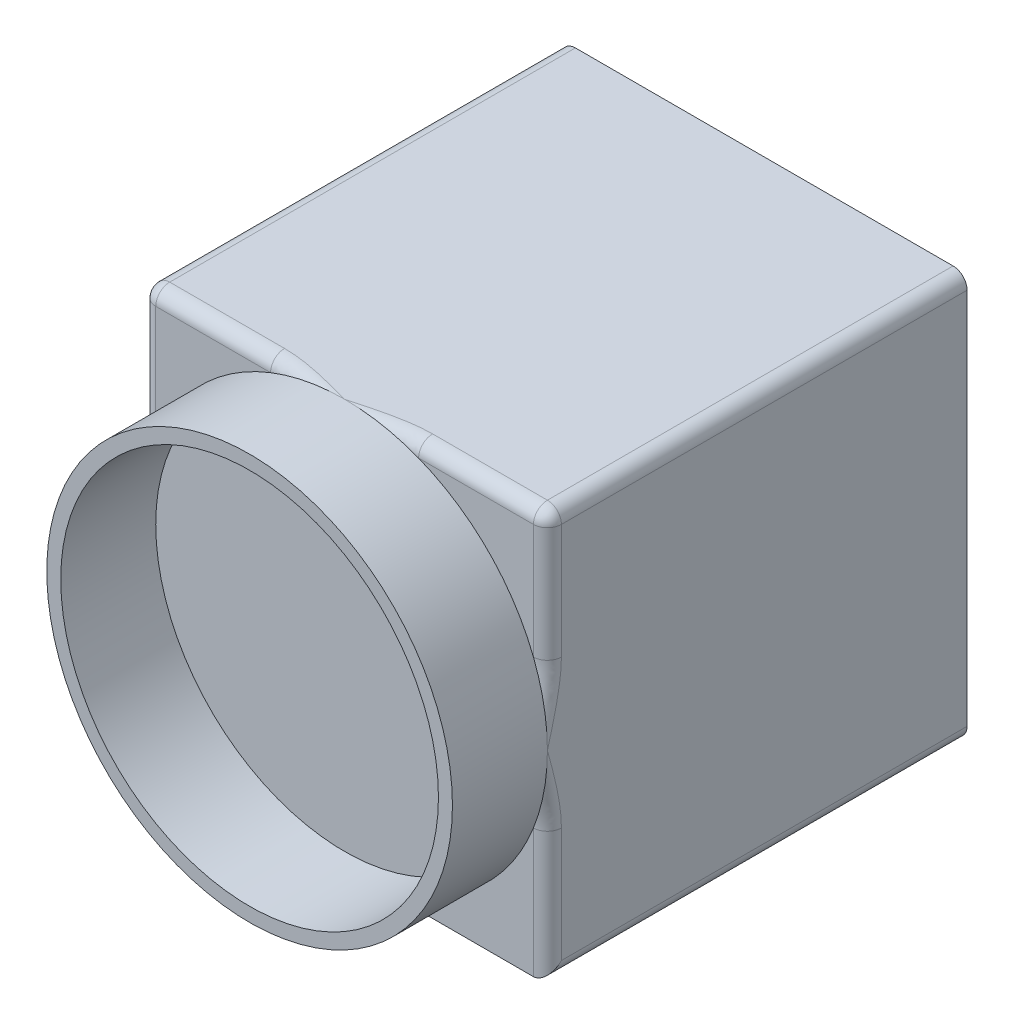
ISO-10303-21;
HEADER;
FILE_DESCRIPTION(('STEP AP214'),'2;1');
FILE_NAME('part.step','',(''),(''),'','','');
FILE_SCHEMA(('AUTOMOTIVE_DESIGN { 1 0 10303 214 1 1 1 1 }'));
ENDSEC;
DATA;
#1=APPLICATION_CONTEXT('core data for automotive mechanical design processes');
#2=APPLICATION_PROTOCOL_DEFINITION('international standard','automotive_design',2000,#1);
#3=PRODUCT_CONTEXT('',#1,'mechanical');
#4=PRODUCT('Part','Part','',(#3));
#5=PRODUCT_RELATED_PRODUCT_CATEGORY('part','',(#4));
#6=PRODUCT_DEFINITION_FORMATION('','',#4);
#7=PRODUCT_DEFINITION_CONTEXT('part definition',#1,'design');
#8=PRODUCT_DEFINITION('design','',#6,#7);
#9=PRODUCT_DEFINITION_SHAPE('','',#8);
#10=(LENGTH_UNIT() NAMED_UNIT(*) SI_UNIT(.MILLI.,.METRE.));
#11=(NAMED_UNIT(*) PLANE_ANGLE_UNIT() SI_UNIT($,.RADIAN.));
#12=(NAMED_UNIT(*) SI_UNIT($,.STERADIAN.) SOLID_ANGLE_UNIT());
#13=UNCERTAINTY_MEASURE_WITH_UNIT(LENGTH_MEASURE(1.E-05),#10,'distance_accuracy_value','');
#14=(GEOMETRIC_REPRESENTATION_CONTEXT(3) GLOBAL_UNCERTAINTY_ASSIGNED_CONTEXT((#13)) GLOBAL_UNIT_ASSIGNED_CONTEXT((#10,
#11,#12)) REPRESENTATION_CONTEXT('',''));
#15=CARTESIAN_POINT('',(0.,0.,0.));
#16=DIRECTION('',(0.,0.,1.));
#17=DIRECTION('',(1.,0.,0.));
#18=AXIS2_PLACEMENT_3D('',#15,#16,#17);
#19=CARTESIAN_POINT('',(0.,0.,0.));
#20=DIRECTION('',(0.,0.,-1.));
#21=DIRECTION('',(-1.,0.,0.));
#22=AXIS2_PLACEMENT_3D('',#19,#20,#21);
#23=PLANE('',#22);
#24=DIRECTION('',(0.,1.,0.));
#25=VECTOR('',#24,1.);
#26=CARTESIAN_POINT('',(13.5,14.5,0.));
#27=LINE('',#26,#25);
#28=CARTESIAN_POINT('',(13.5,5.29150262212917,0.));
#29=VERTEX_POINT('',#28);
#30=CARTESIAN_POINT('',(13.5,13.5,0.));
#31=VERTEX_POINT('',#30);
#32=EDGE_CURVE('E350',#29,#31,#27,.T.);
#33=ORIENTED_EDGE('',*,*,#32,.T.);
#34=DIRECTION('',(-1.,0.,0.));
#35=VECTOR('',#34,1.);
#36=CARTESIAN_POINT('',(0.,13.5,0.));
#37=LINE('',#36,#35);
#38=CARTESIAN_POINT('',(5.29150262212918,13.5,0.));
#39=VERTEX_POINT('',#38);
#40=EDGE_CURVE('E352',#31,#39,#37,.T.);
#41=ORIENTED_EDGE('',*,*,#40,.T.);
#42=CARTESIAN_POINT('',(0.,0.,0.));
#43=DIRECTION('',(0.,0.,1.));
#44=DIRECTION('',(1.,0.,0.));
#45=AXIS2_PLACEMENT_3D('',#42,#43,#44);
#46=CIRCLE('',#45,14.5);
#47=EDGE_CURVE('E210',#29,#39,#46,.T.);
#48=ORIENTED_EDGE('',*,*,#47,.F.);
#49=EDGE_LOOP('',(#33,#41,#48));
#50=FACE_BOUND('',#49,.T.);
#51=ADVANCED_FACE('F36',(#50),#23,.F.);
#52=CARTESIAN_POINT('',(-5.29150262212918,13.5,0.));
#53=VERTEX_POINT('',#52);
#54=CARTESIAN_POINT('',(-13.5,5.29150262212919,0.));
#55=VERTEX_POINT('',#54);
#56=EDGE_CURVE('E486',#53,#55,#46,.T.);
#57=ORIENTED_EDGE('',*,*,#56,.F.);
#58=DIRECTION('',(-1.,0.,0.));
#59=VECTOR('',#58,1.);
#60=CARTESIAN_POINT('',(-14.5,13.5,0.));
#61=LINE('',#60,#59);
#62=CARTESIAN_POINT('',(-13.5,13.5,0.));
#63=VERTEX_POINT('',#62);
#64=EDGE_CURVE('E228',#53,#63,#61,.T.);
#65=ORIENTED_EDGE('',*,*,#64,.T.);
#66=DIRECTION('',(0.,-1.,0.));
#67=VECTOR('',#66,1.);
#68=CARTESIAN_POINT('',(-13.5,0.,0.));
#69=LINE('',#68,#67);
#70=EDGE_CURVE('E226',#63,#55,#69,.T.);
#71=ORIENTED_EDGE('',*,*,#70,.T.);
#72=EDGE_LOOP('',(#57,#65,#71));
#73=FACE_BOUND('',#72,.T.);
#74=ADVANCED_FACE('F435',(#73),#23,.F.);
#75=CARTESIAN_POINT('',(-13.5,-5.29150262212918,0.));
#76=VERTEX_POINT('',#75);
#77=CARTESIAN_POINT('',(0.,-14.5,0.));
#78=VERTEX_POINT('',#77);
#79=EDGE_CURVE('E471',#76,#78,#46,.T.);
#80=ORIENTED_EDGE('',*,*,#79,.F.);
#81=DIRECTION('',(0.,-1.,0.));
#82=VECTOR('',#81,1.);
#83=CARTESIAN_POINT('',(-13.5,-14.5,0.));
#84=LINE('',#83,#82);
#85=CARTESIAN_POINT('',(-13.5,-14.5,0.));
#86=VERTEX_POINT('',#85);
#87=EDGE_CURVE('E474',#76,#86,#84,.T.);
#88=ORIENTED_EDGE('',*,*,#87,.T.);
#89=DIRECTION('',(1.,0.,0.));
#90=VECTOR('',#89,1.);
#91=CARTESIAN_POINT('',(-14.5,-14.5,0.));
#92=LINE('',#91,#90);
#93=EDGE_CURVE('E216',#86,#78,#92,.T.);
#94=ORIENTED_EDGE('',*,*,#93,.T.);
#95=EDGE_LOOP('',(#80,#88,#94));
#96=FACE_BOUND('',#95,.T.);
#97=ADVANCED_FACE('F440',(#96),#23,.F.);
#98=CARTESIAN_POINT('',(-14.5,-14.5,-30.));
#99=DIRECTION('',(-1.,0.,0.));
#100=DIRECTION('',(0.,0.,1.));
#101=AXIS2_PLACEMENT_3D('',#98,#99,#100);
#102=PLANE('',#101);
#103=DIRECTION('',(0.,-1.,0.));
#104=VECTOR('',#103,1.);
#105=CARTESIAN_POINT('',(-14.5,-14.5,-30.));
#106=LINE('',#105,#104);
#107=CARTESIAN_POINT('',(-14.5,13.5,-30.));
#108=VERTEX_POINT('',#107);
#109=CARTESIAN_POINT('',(-14.5,-13.5,-30.));
#110=VERTEX_POINT('',#109);
#111=EDGE_CURVE('E212',#108,#110,#106,.T.);
#112=ORIENTED_EDGE('',*,*,#111,.T.);
#113=DIRECTION('',(0.,0.,1.));
#114=VECTOR('',#113,1.);
#115=CARTESIAN_POINT('',(-14.5,-13.5,-30.));
#116=LINE('',#115,#114);
#117=CARTESIAN_POINT('',(-14.5,-13.5,-1.));
#118=VERTEX_POINT('',#117);
#119=EDGE_CURVE('E643',#110,#118,#116,.T.);
#120=ORIENTED_EDGE('',*,*,#119,.T.);
#121=DIRECTION('',(0.,-1.,0.));
#122=VECTOR('',#121,1.);
#123=CARTESIAN_POINT('',(-14.5,0.,-1.));
#124=LINE('',#123,#122);
#125=CARTESIAN_POINT('',(-14.5,-5.29150262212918,-1.));
#126=VERTEX_POINT('',#125);
#127=EDGE_CURVE('E645',#118,#126,#124,.F.);
#128=ORIENTED_EDGE('',*,*,#127,.T.);
#129=CARTESIAN_POINT('',(-12.9922029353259,-6.43837424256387,0.));
#130=CARTESIAN_POINT('',(-13.4921722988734,-6.35228872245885,0.281853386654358));
#131=CARTESIAN_POINT('',(-13.9960861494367,-6.43638892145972,0.00650015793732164));
#132=CARTESIAN_POINT('',(-14.5,-6.5204891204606,-0.268853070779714));
#133=CARTESIAN_POINT('',(-14.5,-6.69001652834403,-0.823904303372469));
#134=CARTESIAN_POINT('',(-13.0121156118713,-6.39819398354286,0.));
#135=CARTESIAN_POINT('',(-13.5121723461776,-6.32192687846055,0.268662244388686));
#136=CARTESIAN_POINT('',(-14.0061188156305,-6.40140491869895,-0.010189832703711));
#137=CARTESIAN_POINT('',(-14.5,-6.4811258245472,-0.288931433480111));
#138=CARTESIAN_POINT('',(-14.5,-6.63801083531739,-0.839772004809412));
#139=CARTESIAN_POINT('',(-13.0320910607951,-6.35741430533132,0.));
#140=CARTESIAN_POINT('',(-13.5317073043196,-6.28957358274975,0.255463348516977));
#141=CARTESIAN_POINT('',(-14.0158831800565,-6.36470230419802,-0.0263496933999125));
#142=CARTESIAN_POINT('',(-14.5,-6.44007190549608,-0.308065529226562));
#143=CARTESIAN_POINT('',(-14.5,-6.58559193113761,-0.854220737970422));
#144=CARTESIAN_POINT('',(-13.0720631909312,-6.27481157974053,0.));
#145=CARTESIAN_POINT('',(-13.5697489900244,-6.22171760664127,0.229409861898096));
#146=CARTESIAN_POINT('',(-14.034904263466,-6.28847651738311,-0.0574978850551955));
#147=CARTESIAN_POINT('',(-14.5,-6.35546982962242,-0.344308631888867));
#148=CARTESIAN_POINT('',(-14.5,-6.48014831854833,-0.880577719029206));
#149=CARTESIAN_POINT('',(-13.0920598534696,-6.23298914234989,0.));
#150=CARTESIAN_POINT('',(-13.5882698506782,-6.1862234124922,0.216548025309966));
#151=CARTESIAN_POINT('',(-14.0441612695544,-6.24895497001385,-0.0724868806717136));
#152=CARTESIAN_POINT('',(-14.5,-6.31192256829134,-0.361438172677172));
#153=CARTESIAN_POINT('',(-14.5,-6.42712397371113,-0.892487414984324));
#154=CARTESIAN_POINT('',(-13.1319453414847,-6.14851123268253,0.));
#155=CARTESIAN_POINT('',(-13.6243209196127,-6.11276254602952,0.19143580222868));
#156=CARTESIAN_POINT('',(-14.0621864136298,-6.16776379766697,-0.101167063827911));
#157=CARTESIAN_POINT('',(-14.5,-6.22300013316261,-0.393687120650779));
#158=CARTESIAN_POINT('',(-14.5,-6.32075750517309,-0.914055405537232));
#159=CARTESIAN_POINT('',(-13.1518343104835,-6.10585799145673,0.));
#160=CARTESIAN_POINT('',(-13.6418648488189,-6.07480443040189,0.179176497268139));
#161=CARTESIAN_POINT('',(-14.0709556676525,-6.12609953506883,-0.114861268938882));
#162=CARTESIAN_POINT('',(-14.5,-6.17762584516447,-0.408827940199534));
#163=CARTESIAN_POINT('',(-14.5,-6.26741644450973,-0.923719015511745));
#164=CARTESIAN_POINT('',(-13.1914898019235,-6.01970487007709,0.));
#165=CARTESIAN_POINT('',(-13.6760797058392,-5.99675832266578,0.155342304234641));
#166=CARTESIAN_POINT('',(-14.0880629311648,-6.04093388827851,-0.1409889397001));
#167=CARTESIAN_POINT('',(-14.5,-6.08533945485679,-0.437249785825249));
#168=CARTESIAN_POINT('',(-14.5,-6.16040761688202,-0.941063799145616));
#169=CARTESIAN_POINT('',(-13.2112563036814,-5.97620485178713,0.));
#170=CARTESIAN_POINT('',(-13.6927606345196,-5.9566690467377,0.143760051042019));
#171=CARTESIAN_POINT('',(-14.0964008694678,-5.99743220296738,-0.153422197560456));
#172=CARTESIAN_POINT('',(-14.5,-6.03842071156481,-0.450545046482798));
#173=CARTESIAN_POINT('',(-14.5,-6.10673979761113,-0.948744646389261));
#174=CARTESIAN_POINT('',(-13.2698135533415,-5.84560270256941,0.));
#175=CARTESIAN_POINT('',(-13.7410740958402,-5.83502010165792,0.110496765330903));
#176=CARTESIAN_POINT('',(-14.1206174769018,-5.8657413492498,-0.188572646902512));
#177=CARTESIAN_POINT('',(-14.5,-5.89733376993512,-0.487408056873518));
#178=CARTESIAN_POINT('',(-14.5,-5.94669319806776,-0.968955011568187));
#179=CARTESIAN_POINT('',(-13.3083456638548,-5.75737608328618,0.));
#180=CARTESIAN_POINT('',(-13.7716985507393,-5.75055680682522,0.0897876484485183));
#181=CARTESIAN_POINT('',(-14.1359146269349,-5.77537011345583,-0.209485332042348));
#182=CARTESIAN_POINT('',(-14.5,-5.80100402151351,-0.508590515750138));
#183=CARTESIAN_POINT('',(-14.5,-5.83998376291,-0.978901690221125));
#184=CARTESIAN_POINT('',(-13.3844047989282,-5.57827884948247,0.));
#185=CARTESIAN_POINT('',(-13.8301575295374,-5.5765341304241,0.0514527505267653));
#186=CARTESIAN_POINT('',(-14.1651428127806,-5.5904772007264,-0.246812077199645));
#187=CARTESIAN_POINT('',(-14.5,-5.60523674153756,-0.544914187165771));
#188=CARTESIAN_POINT('',(-14.5,-5.62615134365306,-0.993044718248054));
#189=CARTESIAN_POINT('',(-13.4219311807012,-5.48740661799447,0.));
#190=CARTESIAN_POINT('',(-13.8580427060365,-5.48693337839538,0.0337835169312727));
#191=CARTESIAN_POINT('',(-14.1790729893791,-5.49595296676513,-0.263223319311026));
#192=CARTESIAN_POINT('',(-14.5,-5.50573123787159,-0.560122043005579));
#193=CARTESIAN_POINT('',(-14.5,-5.51902814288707,-0.997237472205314));
#194=CARTESIAN_POINT('',(-13.5370185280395,-5.20030920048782,0.));
#195=CARTESIAN_POINT('',(-13.9407958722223,-5.20277821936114,-0.0164314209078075));
#196=CARTESIAN_POINT('',(-14.2206336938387,-5.19650338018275,-0.308059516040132));
#197=CARTESIAN_POINT('',(-14.5,-5.19359532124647,-0.599172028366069));
#198=CARTESIAN_POINT('',(-14.5,-5.18477974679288,-1.00278418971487));
#199=CARTESIAN_POINT('',(-13.612388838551,-4.99998135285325,0.));
#200=CARTESIAN_POINT('',(-13.9919913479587,-5.00001663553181,-0.0442154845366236));
#201=CARTESIAN_POINT('',(-14.2461519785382,-4.98639938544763,-0.329378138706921));
#202=CARTESIAN_POINT('',(-14.5,-4.97561106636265,-0.614344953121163));
#203=CARTESIAN_POINT('',(-14.5,-4.95750858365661,-0.995711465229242));
#204=CARTESIAN_POINT('',(-13.7558807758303,-4.59052533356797,0.));
#205=CARTESIAN_POINT('',(-14.08523125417,-4.58449998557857,-0.0881374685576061));
#206=CARTESIAN_POINT('',(-14.2927663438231,-4.55891466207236,-0.357546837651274));
#207=CARTESIAN_POINT('',(-14.5,-4.53613112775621,-0.626780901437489));
#208=CARTESIAN_POINT('',(-14.5,-4.50394747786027,-0.965850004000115));
#209=CARTESIAN_POINT('',(-13.8239951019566,-4.38138858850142,0.));
#210=CARTESIAN_POINT('',(-14.1275145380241,-4.37129165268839,-0.104476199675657));
#211=CARTESIAN_POINT('',(-14.3138579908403,-4.34152688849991,-0.364382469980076));
#212=CARTESIAN_POINT('',(-14.5,-4.31407107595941,-0.624276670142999));
#213=CARTESIAN_POINT('',(-14.5,-4.27765873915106,-0.943045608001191));
#214=CARTESIAN_POINT('',(-13.9519353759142,-3.95513864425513,0.));
#215=CARTESIAN_POINT('',(-14.2043080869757,-3.93792134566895,-0.127689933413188));
#216=CARTESIAN_POINT('',(-14.3522543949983,-3.90189329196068,-0.366683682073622));
#217=CARTESIAN_POINT('',(-14.5,-3.86816082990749,-0.605665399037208));
#218=CARTESIAN_POINT('',(-14.5,-3.82598464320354,-0.8855322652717));
#219=CARTESIAN_POINT('',(-14.0117372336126,-3.73800447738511,0.));
#220=CARTESIAN_POINT('',(-14.238965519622,-3.71731425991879,-0.134663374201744));
#221=CARTESIAN_POINT('',(-14.3695482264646,-3.67963542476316,-0.362116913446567));
#222=CARTESIAN_POINT('',(-14.5,-3.64381195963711,-0.589640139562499));
#223=CARTESIAN_POINT('',(-14.5,-3.60060367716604,-0.850789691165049));
#224=CARTESIAN_POINT('',(-14.1218716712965,-3.29762271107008,0.));
#225=CARTESIAN_POINT('',(-14.3011783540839,-3.27199747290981,-0.141006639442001));
#226=CARTESIAN_POINT('',(-14.4006520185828,-3.23264667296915,-0.344095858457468));
#227=CARTESIAN_POINT('',(-14.5,-3.19512808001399,-0.547264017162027));
#228=CARTESIAN_POINT('',(-14.5,-3.15153163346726,-0.772344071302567));
#229=CARTESIAN_POINT('',(-14.1722077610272,-3.0743774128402,0.));
#230=CARTESIAN_POINT('',(-14.3288542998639,-3.04689473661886,-0.140447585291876));
#231=CARTESIAN_POINT('',(-14.4144632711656,-3.00791673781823,-0.330644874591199));
#232=CARTESIAN_POINT('',(-14.5,-2.97036159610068,-0.52096071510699));
#233=CARTESIAN_POINT('',(-14.5,-2.92783995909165,-0.728644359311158));
#234=CARTESIAN_POINT('',(-14.3090036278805,-2.39149391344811,0.));
#235=CARTESIAN_POINT('',(-14.4024432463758,-2.36416097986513,-0.129944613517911));
#236=CARTESIAN_POINT('',(-14.4513845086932,-2.3258666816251,-0.279837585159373));
#237=CARTESIAN_POINT('',(-14.5,-2.29341328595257,-0.430140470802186));
#238=CARTESIAN_POINT('',(-14.5,-2.25340204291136,-0.586453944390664));
#239=CARTESIAN_POINT('',(-14.3796305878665,-1.92401840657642,0.));
#240=CARTESIAN_POINT('',(-14.438963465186,-1.89782687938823,-0.11107730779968));
#241=CARTESIAN_POINT('',(-14.4695222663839,-1.86616430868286,-0.23210891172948));
#242=CARTESIAN_POINT('',(-14.5,-1.83735805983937,-0.353445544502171));
#243=CARTESIAN_POINT('',(-14.5,-1.80485547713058,-0.477701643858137));
#244=CARTESIAN_POINT('',(-14.4746932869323,-0.979082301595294,0.));
#245=CARTESIAN_POINT('',(-14.4873751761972,-0.963662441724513,-0.0620270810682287));
#246=CARTESIAN_POINT('',(-14.4937209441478,-0.945399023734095,-0.123959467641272));
#247=CARTESIAN_POINT('',(-14.5,-0.929900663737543,-0.186246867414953));
#248=CARTESIAN_POINT('',(-14.5,-0.911677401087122,-0.24802245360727));
#249=CARTESIAN_POINT('',(-14.4991862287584,-0.501634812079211,0.));
#250=CARTESIAN_POINT('',(-14.4995933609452,-0.493010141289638,-0.0317780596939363));
#251=CARTESIAN_POINT('',(-14.4997968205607,-0.484338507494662,-0.0635545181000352));
#252=CARTESIAN_POINT('',(-14.5000000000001,-0.475712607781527,-0.095336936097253));
#253=CARTESIAN_POINT('',(-14.5,-0.467041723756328,-0.127110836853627));
#254=CARTESIAN_POINT('',(-14.4999866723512,-0.0200689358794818,0.));
#255=CARTESIAN_POINT('',(-14.4999933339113,-0.0197229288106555,-0.00127133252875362));
#256=CARTESIAN_POINT('',(-14.4999966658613,-0.0193769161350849,-0.0025426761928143));
#257=CARTESIAN_POINT('',(-14.5,-0.019030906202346,-0.0038140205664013));
#258=CARTESIAN_POINT('',(-14.5,-0.0186848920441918,-0.00508536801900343));
#259=CARTESIAN_POINT('',(-14.4999916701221,-0.0160547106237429,0.));
#260=CARTESIAN_POINT('',(-14.4999958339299,-0.0157779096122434,-0.00101704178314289));
#261=CARTESIAN_POINT('',(-14.4999979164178,-0.0155011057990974,-0.00203408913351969));
#262=CARTESIAN_POINT('',(-14.5,-0.0152243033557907,-0.00305113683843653));
#263=CARTESIAN_POINT('',(-14.5,-0.0149474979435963,-0.004068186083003));
#264=CARTESIAN_POINT('',(-14.4999983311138,-0.00802698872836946,0.));
#265=CARTESIAN_POINT('',(-14.4999991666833,-0.00788859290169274,-0.00050850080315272));
#266=CARTESIAN_POINT('',(-14.499999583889,-0.00775019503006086,-0.00101700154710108));
#267=CARTESIAN_POINT('',(-14.5,-0.00761179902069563,-0.00152550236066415));
#268=CARTESIAN_POINT('',(-14.5,-0.00747340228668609,-0.00203400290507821));
#269=CARTESIAN_POINT('',(-14.4999999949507,-0.0040134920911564,0.));
#270=CARTESIAN_POINT('',(-14.4999999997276,-0.00394429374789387,-0.000254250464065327));
#271=CARTESIAN_POINT('',(-14.5000000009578,-0.00387509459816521,-0.000508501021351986));
#272=CARTESIAN_POINT('',(-14.5,-0.00380589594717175,-0.000762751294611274));
#273=CARTESIAN_POINT('',(-14.5,-0.00373670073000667,-0.00101700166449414));
#274=CARTESIAN_POINT('',(-14.5,1.02897578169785E-08,0.));
#275=CARTESIAN_POINT('',(-14.5,1.02897578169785E-08,0.));
#276=CARTESIAN_POINT('',(-14.5,1.02897578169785E-08,0.));
#277=CARTESIAN_POINT('',(-14.5,1.02897578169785E-08,0.));
#278=CARTESIAN_POINT('',(-14.5,0.,0.));
#279=(BOUNDED_SURFACE() B_SPLINE_SURFACE(3,2,((#129,#130,#131,#132,#133),(#134,#135,#136,#137,
#138),(#139,#140,#141,#142,#143),(#144,#145,#146,#147,#148),(#149,#150,#151,#152,#153),(#154,
#155,#156,#157,#158),(#159,#160,#161,#162,#163),(#164,#165,#166,#167,#168),(#169,#170,#171,#172,
#173),(#174,#175,#176,#177,#178),(#179,#180,#181,#182,#183),(#184,#185,#186,#187,#188),(#189,
#190,#191,#192,#193),(#194,#195,#196,#197,#198),(#199,#200,#201,#202,#203),(#204,#205,#206,#207,
#208),(#209,#210,#211,#212,#213),(#214,#215,#216,#217,#218),(#219,#220,#221,#222,#223),(#224,
#225,#226,#227,#228),(#229,#230,#231,#232,#233),(#234,#235,#236,#237,#238),(#239,#240,#241,#242,
#243),(#244,#245,#246,#247,#248),(#249,#250,#251,#252,#253),(#254,#255,#256,#257,#258),(#259,
#260,#261,#262,#263),(#264,#265,#266,#267,#268),(#269,#270,#271,#272,#273),(#274,#275,#276,#277,
#278)),.UNSPECIFIED.,.F.,.F.,.F.) B_SPLINE_SURFACE_WITH_KNOTS((4,2,2,2,2,2,2,2,2,2,2,2,2,2,4),
(3,2,3),(0.,0.163070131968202,0.326047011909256,0.488634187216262,0.651248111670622,
0.972549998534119,1.2940525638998,1.9753185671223,2.65726368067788,3.34114565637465,
4.02477355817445,5.40886762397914,6.79124438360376,6.80286440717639,6.81448228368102),(0.,0.5,
1.),.UNSPECIFIED.) GEOMETRIC_REPRESENTATION_ITEM() RATIONAL_B_SPLINE_SURFACE(((1.,
0.86489483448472,1.,0.86489483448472,1.),(1.,0.867794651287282,1.,0.867794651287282,1.),(1.,
0.870602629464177,1.,0.870602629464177,1.),(1.,0.876047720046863,1.,0.876047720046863,1.),(1.,
0.878684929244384,1.,0.878684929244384,1.),(1.,0.883798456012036,1.,0.883798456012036,1.),(1.,
0.886275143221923,1.,0.886275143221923,1.),(1.,0.891087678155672,1.,0.891087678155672,1.),(1.,
0.893423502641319,1.,0.893423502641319,1.),(1.,0.900182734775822,1.,0.900182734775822,1.),(1.,
0.904418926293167,1.,0.904418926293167,1.),(1.,0.912462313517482,1.,0.912462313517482,1.),(1.,
0.916269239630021,1.,0.916269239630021,1.),(1.,0.927564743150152,1.,0.927564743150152,1.),(1.,
0.934406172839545,1.,0.934406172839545,1.),(1.,0.946795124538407,1.,0.946795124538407,1.),(1.,
0.952341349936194,1.,0.952341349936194,1.),(1.,0.962368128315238,1.,0.962368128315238,1.),(1.,
0.966845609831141,1.,0.966845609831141,1.),(1.,0.974854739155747,1.,0.974854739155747,1.),(1.,
0.978386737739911,1.,0.978386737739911,1.),(1.,0.98779213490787,1.,0.98779213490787,1.),(1.,
0.992356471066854,1.,0.992356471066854,1.),(1.,0.998433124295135,1.,0.998433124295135,1.),(1.,
0.999949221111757,1.,0.999949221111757,1.),(1.,0.999999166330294,1.,0.999999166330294,1.),(1.,
0.999999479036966,1.,0.999999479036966,1.),(1.,0.999999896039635,1.,0.999999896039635,1.),(1.,
1.00000000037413,1.,1.00000000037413,1.),(1.,1.,1.,1.,1.))) REPRESENTATION_ITEM('') SURFACE());
#280=CARTESIAN_POINT('',(-14.5,-6.69001652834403,-0.823904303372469));
#281=CARTESIAN_POINT('',(-14.5,-6.63801083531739,-0.839772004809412));
#282=CARTESIAN_POINT('',(-14.5,-6.58559193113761,-0.854220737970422));
#283=CARTESIAN_POINT('',(-14.5,-6.48014831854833,-0.880577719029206));
#284=CARTESIAN_POINT('',(-14.5,-6.42712397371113,-0.892487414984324));
#285=CARTESIAN_POINT('',(-14.5,-6.32075750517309,-0.914055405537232));
#286=CARTESIAN_POINT('',(-14.5,-6.26741644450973,-0.923719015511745));
#287=CARTESIAN_POINT('',(-14.5,-6.16040761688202,-0.941063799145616));
#288=CARTESIAN_POINT('',(-14.5,-6.10673979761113,-0.948744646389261));
#289=CARTESIAN_POINT('',(-14.5,-5.94669319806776,-0.968955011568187));
#290=CARTESIAN_POINT('',(-14.5,-5.83998376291,-0.978901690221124));
#291=CARTESIAN_POINT('',(-14.5,-5.62615134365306,-0.993044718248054));
#292=CARTESIAN_POINT('',(-14.5,-5.51902814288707,-0.997237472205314));
#293=CARTESIAN_POINT('',(-14.5,-5.18477974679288,-1.00278418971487));
#294=CARTESIAN_POINT('',(-14.5,-4.95750858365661,-0.995711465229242));
#295=CARTESIAN_POINT('',(-14.5,-4.50394747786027,-0.965850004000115));
#296=CARTESIAN_POINT('',(-14.5,-4.27765873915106,-0.943045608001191));
#297=CARTESIAN_POINT('',(-14.5,-3.82598464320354,-0.8855322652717));
#298=CARTESIAN_POINT('',(-14.5,-3.60060367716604,-0.850789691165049));
#299=CARTESIAN_POINT('',(-14.5,-3.15153163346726,-0.772344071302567));
#300=CARTESIAN_POINT('',(-14.5,-2.92783995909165,-0.728644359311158));
#301=CARTESIAN_POINT('',(-14.5,-2.25340204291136,-0.586453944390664));
#302=CARTESIAN_POINT('',(-14.5,-1.80485547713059,-0.477701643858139));
#303=CARTESIAN_POINT('',(-14.5,-0.911677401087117,-0.248022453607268));
#304=CARTESIAN_POINT('',(-14.5,-0.467041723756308,-0.127110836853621));
#305=CARTESIAN_POINT('',(-14.5,-0.0186848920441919,-0.00508536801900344));
#306=CARTESIAN_POINT('',(-14.5,-0.0149474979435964,-0.00406818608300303));
#307=CARTESIAN_POINT('',(-14.5,-0.00747340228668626,-0.00203400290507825));
#308=CARTESIAN_POINT('',(-14.5,-0.00373670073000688,-0.0010170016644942));
#309=CARTESIAN_POINT('',(-14.5,0.,0.));
#310=B_SPLINE_CURVE_WITH_KNOTS('',3,(#280,#281,#282,#283,#284,#285,#286,#287,#288,#289,#290,
#291,#292,#293,#294,#295,#296,#297,#298,#299,#300,#301,#302,#303,#304,#305,#306,#307,#308,#309),
.UNSPECIFIED.,.F.,.F.,(4,2,2,2,2,2,2,2,2,2,2,2,2,2,4),(0.,0.163070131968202,0.326047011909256,
0.488634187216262,0.651248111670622,0.972549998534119,1.2940525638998,1.9753185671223,
2.65726368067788,3.34114565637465,4.02477355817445,5.40886762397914,6.79124438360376,
6.80286440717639,6.81448228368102),.UNSPECIFIED.);
#311=CARTESIAN_POINT('',(-14.5,0.,0.));
#312=VERTEX_POINT('',#311);
#313=EDGE_CURVE('E599',#126,#312,#310,.T.);
#314=ORIENTED_EDGE('',*,*,#313,.T.);
#315=CARTESIAN_POINT('',(-14.5,6.69001652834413,-0.823904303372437));
#316=CARTESIAN_POINT('',(-14.5,6.52048912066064,-0.268853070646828));
#317=CARTESIAN_POINT('',(-13.9960861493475,6.43638892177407,0.00650015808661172));
#318=CARTESIAN_POINT('',(-13.492172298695,6.3522887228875,0.281853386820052));
#319=CARTESIAN_POINT('',(-12.9922029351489,6.43837424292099,0.));
#320=CARTESIAN_POINT('',(-14.5,6.63801083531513,-0.839772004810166));
#321=CARTESIAN_POINT('',(-14.5,6.48112582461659,-0.288931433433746));
#322=CARTESIAN_POINT('',(-14.0061188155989,6.4014049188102,-0.0101898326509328));
#323=CARTESIAN_POINT('',(-13.5121723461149,6.32192687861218,0.268662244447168));
#324=CARTESIAN_POINT('',(-13.0121156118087,6.3981939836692,0.));
#325=CARTESIAN_POINT('',(-14.5,6.58559193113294,-0.854220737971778));
#326=CARTESIAN_POINT('',(-14.5,6.44007190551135,-0.30806552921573));
#327=CARTESIAN_POINT('',(-14.0158831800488,6.36470230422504,-0.0263496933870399));
#328=CARTESIAN_POINT('',(-13.5317073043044,6.28957358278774,0.255463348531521));
#329=CARTESIAN_POINT('',(-13.0320910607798,6.35741430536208,0.));
#330=CARTESIAN_POINT('',(-14.5,6.48014831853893,-0.880577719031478));
#331=CARTESIAN_POINT('',(-14.5,6.35546982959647,-0.344308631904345));
#332=CARTESIAN_POINT('',(-14.0349042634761,6.28847651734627,-0.0574978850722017));
#333=CARTESIAN_POINT('',(-13.5697489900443,6.22171760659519,0.229409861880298));
#334=CARTESIAN_POINT('',(-13.0720631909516,6.27481157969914,0.));
#335=CARTESIAN_POINT('',(-14.5,6.42712397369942,-0.892487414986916));
#336=CARTESIAN_POINT('',(-14.5,6.31192256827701,-0.361438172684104));
#337=CARTESIAN_POINT('',(-14.0441612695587,6.24895496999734,-0.0724868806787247));
#338=CARTESIAN_POINT('',(-13.5882698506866,6.18622341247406,0.216548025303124));
#339=CARTESIAN_POINT('',(-13.0920598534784,6.23298914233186,0.));
#340=CARTESIAN_POINT('',(-14.5,6.32075750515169,-0.914055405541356));
#341=CARTESIAN_POINT('',(-14.5,6.22300013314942,-0.393687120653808));
#342=CARTESIAN_POINT('',(-14.0621864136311,6.16776379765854,-0.101167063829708));
#343=CARTESIAN_POINT('',(-13.6243209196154,6.11276254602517,0.191435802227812));
#344=CARTESIAN_POINT('',(-13.1319453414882,6.14851123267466,0.));
#345=CARTESIAN_POINT('',(-14.5,6.26741644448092,-0.923719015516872));
#346=CARTESIAN_POINT('',(-14.5,6.17762584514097,-0.408827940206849));
#347=CARTESIAN_POINT('',(-14.0709556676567,6.12609953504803,-0.114861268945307));
#348=CARTESIAN_POINT('',(-13.6418648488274,6.07480443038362,0.179176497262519));
#349=CARTESIAN_POINT('',(-13.1518343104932,6.10585799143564,0.));
#350=CARTESIAN_POINT('',(-14.5,6.16040761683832,-0.941063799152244));
#351=CARTESIAN_POINT('',(-14.5,6.08533945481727,-0.437249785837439));
#352=CARTESIAN_POINT('',(-14.0880629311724,6.04093388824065,-0.140988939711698));
#353=CARTESIAN_POINT('',(-13.6760797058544,5.99675832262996,0.155342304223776));
#354=CARTESIAN_POINT('',(-13.1914898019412,6.01970487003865,0.));
#355=CARTESIAN_POINT('',(-14.5,6.10673979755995,-0.948744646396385));
#356=CARTESIAN_POINT('',(-14.5,6.03842071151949,-0.450545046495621));
#357=CARTESIAN_POINT('',(-14.096400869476,5.99743220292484,-0.153422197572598));
#358=CARTESIAN_POINT('',(-13.6927606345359,5.95666904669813,0.143760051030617));
#359=CARTESIAN_POINT('',(-13.2112563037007,5.97620485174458,0.));
#360=CARTESIAN_POINT('',(-14.5,5.94669319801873,-0.96895501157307));
#361=CARTESIAN_POINT('',(-14.5,5.89733376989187,-0.487408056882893));
#362=CARTESIAN_POINT('',(-14.1206174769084,5.86574134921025,-0.18857264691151));
#363=CARTESIAN_POINT('',(-13.7410740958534,5.83502010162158,0.110496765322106));
#364=CARTESIAN_POINT('',(-13.2698135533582,5.84560270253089,0.));
#365=CARTESIAN_POINT('',(-14.5,5.83998376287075,-0.978901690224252));
#366=CARTESIAN_POINT('',(-14.5,5.80100402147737,-0.508590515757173));
#367=CARTESIAN_POINT('',(-14.1359146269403,5.7753701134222,-0.209485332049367));
#368=CARTESIAN_POINT('',(-13.7716985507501,5.75055680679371,0.0897876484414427));
#369=CARTESIAN_POINT('',(-13.3083456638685,5.75737608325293,0.));
#370=CARTESIAN_POINT('',(-14.5,5.6261513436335,-0.993044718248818));
#371=CARTESIAN_POINT('',(-14.5,5.6052367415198,-0.544914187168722));
#372=CARTESIAN_POINT('',(-14.1651428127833,5.59047720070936,-0.246812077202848));
#373=CARTESIAN_POINT('',(-13.8301575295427,5.57653413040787,0.0514527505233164));
#374=CARTESIAN_POINT('',(-13.3844047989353,5.57827884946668,0.));
#375=CARTESIAN_POINT('',(-14.5,5.51902814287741,-0.997237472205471));
#376=CARTESIAN_POINT('',(-14.5,5.50573123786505,-0.560122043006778));
#377=CARTESIAN_POINT('',(-14.1790729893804,5.49595296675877,-0.263223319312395));
#378=CARTESIAN_POINT('',(-13.858042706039,5.48693337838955,0.0337835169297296));
#379=CARTESIAN_POINT('',(-13.4219311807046,5.4874066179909,0.));
#380=CARTESIAN_POINT('',(-14.5,5.18477974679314,-1.00278418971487));
#381=CARTESIAN_POINT('',(-14.5,5.19359532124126,-0.599172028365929));
#382=CARTESIAN_POINT('',(-14.2206336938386,5.1965033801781,-0.308059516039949));
#383=CARTESIAN_POINT('',(-13.9407958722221,5.20277821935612,-0.0164314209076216));
#384=CARTESIAN_POINT('',(-13.5370185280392,5.20030920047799,0.));
#385=CARTESIAN_POINT('',(-14.5,4.95750858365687,-0.995711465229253));
#386=CARTESIAN_POINT('',(-14.5,4.97561106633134,-0.614344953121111));
#387=CARTESIAN_POINT('',(-14.2461519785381,4.98639938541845,-0.329378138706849));
#388=CARTESIAN_POINT('',(-13.9919913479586,5.00001663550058,-0.0442154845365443));
#389=CARTESIAN_POINT('',(-13.6123888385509,4.99998135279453,0.));
#390=CARTESIAN_POINT('',(-14.5,4.50394747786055,-0.965850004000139));
#391=CARTESIAN_POINT('',(-14.5,4.53613112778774,-0.626780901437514));
#392=CARTESIAN_POINT('',(-14.2927663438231,4.5589146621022,-0.357546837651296));
#393=CARTESIAN_POINT('',(-14.08523125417,4.58449998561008,-0.0881374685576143));
#394=CARTESIAN_POINT('',(-13.7558807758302,4.59052533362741,0.));
#395=CARTESIAN_POINT('',(-14.5,4.27765873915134,-0.943045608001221));
#396=CARTESIAN_POINT('',(-14.5,4.31407107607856,-0.624276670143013));
#397=CARTESIAN_POINT('',(-14.3138579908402,4.34152688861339,-0.364382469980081));
#398=CARTESIAN_POINT('',(-14.127514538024,4.37129165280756,-0.104476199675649));
#399=CARTESIAN_POINT('',(-13.8239951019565,4.38138858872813,0.));
#400=CARTESIAN_POINT('',(-14.5,3.8259846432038,-0.885532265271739));
#401=CARTESIAN_POINT('',(-14.5,3.86816082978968,-0.605665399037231));
#402=CARTESIAN_POINT('',(-14.3522543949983,3.90189329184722,-0.366683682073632));
#403=CARTESIAN_POINT('',(-14.2043080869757,3.93792134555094,-0.12768993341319));
#404=CARTESIAN_POINT('',(-13.9519353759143,3.95513864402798,0.));
#405=CARTESIAN_POINT('',(-14.5,3.60060367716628,-0.85078969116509));
#406=CARTESIAN_POINT('',(-14.5,3.64381195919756,-0.589640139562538));
#407=CARTESIAN_POINT('',(-14.3695482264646,3.67963542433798,-0.3621169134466));
#408=CARTESIAN_POINT('',(-14.2389655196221,3.71731425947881,-0.134663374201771));
#409=CARTESIAN_POINT('',(-14.0117372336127,3.7380044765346,0.));
#410=CARTESIAN_POINT('',(-14.5,3.15153163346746,-0.772344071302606));
#411=CARTESIAN_POINT('',(-14.5,3.19512808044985,-0.547264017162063));
#412=CARTESIAN_POINT('',(-14.4006520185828,3.23264667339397,-0.344095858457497));
#413=CARTESIAN_POINT('',(-14.3011783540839,3.27199747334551,-0.141006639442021));
#414=CARTESIAN_POINT('',(-14.1218716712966,3.29762271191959,0.));
#415=CARTESIAN_POINT('',(-14.5,2.92783995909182,-0.728644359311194));
#416=CARTESIAN_POINT('',(-14.5,2.97036159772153,-0.520960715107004));
#417=CARTESIAN_POINT('',(-14.4144632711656,3.00791673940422,-0.330644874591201));
#418=CARTESIAN_POINT('',(-14.3288542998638,3.04689473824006,-0.140447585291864));
#419=CARTESIAN_POINT('',(-14.1722077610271,3.07437741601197,0.));
#420=CARTESIAN_POINT('',(-14.5,2.25340204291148,-0.586453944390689));
#421=CARTESIAN_POINT('',(-14.5,2.29341328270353,-0.430140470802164));
#422=CARTESIAN_POINT('',(-14.4513845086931,2.32586667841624,-0.279837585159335));
#423=CARTESIAN_POINT('',(-14.4024432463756,2.36416097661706,-0.129944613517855));
#424=CARTESIAN_POINT('',(-14.3090036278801,2.39149390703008,0.));
#425=CARTESIAN_POINT('',(-14.5,1.80485547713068,-0.47770164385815));
#426=CARTESIAN_POINT('',(-14.5,1.83735804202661,-0.353445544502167));
#427=CARTESIAN_POINT('',(-14.4695222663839,1.86616429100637,-0.232108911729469));
#428=CARTESIAN_POINT('',(-14.4389634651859,1.89782686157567,-0.111077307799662));
#429=CARTESIAN_POINT('',(-14.3796305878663,1.92401837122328,0.));
#430=CARTESIAN_POINT('',(-14.5,0.911677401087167,-0.248022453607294));
#431=CARTESIAN_POINT('',(-14.5,0.929900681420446,-0.18624686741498));
#432=CARTESIAN_POINT('',(-14.4937209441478,0.945399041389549,-0.123959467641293));
#433=CARTESIAN_POINT('',(-14.4873751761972,0.963662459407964,-0.0620270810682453));
#434=CARTESIAN_POINT('',(-14.4746932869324,0.979082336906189,0.));
#435=CARTESIAN_POINT('',(-14.5,0.467041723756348,-0.127110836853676));
#436=CARTESIAN_POINT('',(-14.5000000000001,0.475712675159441,-0.0953369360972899));
#437=CARTESIAN_POINT('',(-14.4997968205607,0.484338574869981,-0.06355451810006));
#438=CARTESIAN_POINT('',(-14.4995933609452,0.493010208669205,-0.0317780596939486));
#439=CARTESIAN_POINT('',(-14.4991862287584,0.50163494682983,0.));
#440=CARTESIAN_POINT('',(-14.5,0.0186848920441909,-0.00508536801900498));
#441=CARTESIAN_POINT('',(-14.5,0.0190309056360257,-0.00381402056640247));
#442=CARTESIAN_POINT('',(-14.4999966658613,0.0193769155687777,-0.00254267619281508));
#443=CARTESIAN_POINT('',(-14.4999933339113,0.0197229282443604,-0.00127133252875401));
#444=CARTESIAN_POINT('',(-14.4999866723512,0.0200689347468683,0.));
#445=CARTESIAN_POINT('',(-14.5,0.0149474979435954,-0.0040681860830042));
#446=CARTESIAN_POINT('',(-14.5,0.0152243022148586,-0.00305113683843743));
#447=CARTESIAN_POINT('',(-14.4999979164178,0.0155011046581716,-0.00203408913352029));
#448=CARTESIAN_POINT('',(-14.4999958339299,0.0157779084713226,-0.00101704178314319));
#449=CARTESIAN_POINT('',(-14.4999916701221,0.0160547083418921,0.));
#450=CARTESIAN_POINT('',(-14.5,0.00747340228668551,-0.00203400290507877));
#451=CARTESIAN_POINT('',(-14.5,0.00761180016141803,-0.00152550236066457));
#452=CARTESIAN_POINT('',(-14.499999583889,0.00775019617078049,-0.00101700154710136));
#453=CARTESIAN_POINT('',(-14.4999991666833,0.00788859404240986,-0.000508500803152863));
#454=CARTESIAN_POINT('',(-14.4999983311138,0.00802699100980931,0.));
#455=CARTESIAN_POINT('',(-14.5,0.00373670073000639,-0.00101700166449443));
#456=CARTESIAN_POINT('',(-14.5,0.0038058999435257,-0.000762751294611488));
#457=CARTESIAN_POINT('',(-14.5000000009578,0.00387509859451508,-0.00050850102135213));
#458=CARTESIAN_POINT('',(-14.4999999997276,0.00394429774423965,-0.000254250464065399));
#459=CARTESIAN_POINT('',(-14.4999999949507,0.00401350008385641,0.));
#460=CARTESIAN_POINT('',(-14.5,0.,0.));
#461=CARTESIAN_POINT('',(-14.5,0.,0.));
#462=CARTESIAN_POINT('',(-14.5,0.,0.));
#463=CARTESIAN_POINT('',(-14.5,0.,0.));
#464=CARTESIAN_POINT('',(-14.5,1.02897578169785E-08,0.));
#465=(BOUNDED_SURFACE() B_SPLINE_SURFACE(3,2,((#315,#316,#317,#318,#319),(#320,#321,#322,#323,
#324),(#325,#326,#327,#328,#329),(#330,#331,#332,#333,#334),(#335,#336,#337,#338,#339),(#340,
#341,#342,#343,#344),(#345,#346,#347,#348,#349),(#350,#351,#352,#353,#354),(#355,#356,#357,#358,
#359),(#360,#361,#362,#363,#364),(#365,#366,#367,#368,#369),(#370,#371,#372,#373,#374),(#375,
#376,#377,#378,#379),(#380,#381,#382,#383,#384),(#385,#386,#387,#388,#389),(#390,#391,#392,#393,
#394),(#395,#396,#397,#398,#399),(#400,#401,#402,#403,#404),(#405,#406,#407,#408,#409),(#410,
#411,#412,#413,#414),(#415,#416,#417,#418,#419),(#420,#421,#422,#423,#424),(#425,#426,#427,#428,
#429),(#430,#431,#432,#433,#434),(#435,#436,#437,#438,#439),(#440,#441,#442,#443,#444),(#445,
#446,#447,#448,#449),(#450,#451,#452,#453,#454),(#455,#456,#457,#458,#459),(#460,#461,#462,#463,
#464)),.UNSPECIFIED.,.F.,.F.,.F.) B_SPLINE_SURFACE_WITH_KNOTS((4,2,2,2,2,2,2,2,2,2,2,2,2,2,4),
(3,2,3),(0.,0.163070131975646,0.326047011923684,0.488634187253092,0.651248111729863,
0.972549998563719,1.29405256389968,1.97531856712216,2.65726368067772,3.34114565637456,
4.02477355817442,5.4088676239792,6.79124438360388,6.80286440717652,6.81448228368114),(0.,0.5,
1.),.UNSPECIFIED.) GEOMETRIC_REPRESENTATION_ITEM() RATIONAL_B_SPLINE_SURFACE(((1.,
0.864894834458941,1.,0.864894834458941,1.),(1.,0.867794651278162,1.,0.867794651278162,1.),(1.,
0.870602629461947,1.,0.870602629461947,1.),(1.,0.876047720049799,1.,0.876047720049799,1.),(1.,
0.878684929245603,1.,0.878684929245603,1.),(1.,0.883798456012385,1.,0.883798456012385,1.),(1.,
0.886275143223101,1.,0.886275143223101,1.),(1.,0.891087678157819,1.,0.891087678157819,1.),(1.,
0.893423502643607,1.,0.893423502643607,1.),(1.,0.900182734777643,1.,0.900182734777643,1.),(1.,
0.904418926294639,1.,0.904418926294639,1.),(1.,0.912462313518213,1.,0.912462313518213,1.),(1.,
0.91626923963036,1.,0.91626923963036,1.),(1.,0.927564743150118,1.,0.927564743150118,1.),(1.,
0.934406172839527,1.,0.934406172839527,1.),(1.,0.946795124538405,1.,0.946795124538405,1.),(1.,
0.952341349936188,1.,0.952341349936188,1.),(1.,0.962368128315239,1.,0.962368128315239,1.),(1.,
0.96684560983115,1.,0.96684560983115,1.),(1.,0.974854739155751,1.,0.974854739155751,1.),(1.,
0.9783867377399,1.,0.9783867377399,1.),(1.,0.987792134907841,1.,0.987792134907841,1.),(1.,
0.992356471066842,1.,0.992356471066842,1.),(1.,0.998433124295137,1.,0.998433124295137,1.),(1.,
0.999949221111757,1.,0.999949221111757,1.),(1.,0.999999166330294,1.,0.999999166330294,1.),(1.,
0.999999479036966,1.,0.999999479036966,1.),(1.,0.999999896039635,1.,0.999999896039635,1.),(1.,
1.00000000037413,1.,1.00000000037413,1.),(1.,1.,1.,1.,1.))) REPRESENTATION_ITEM('') SURFACE());
#466=CARTESIAN_POINT('',(-14.5,6.69001652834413,-0.823904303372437));
#467=CARTESIAN_POINT('',(-14.5,6.63801083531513,-0.839772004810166));
#468=CARTESIAN_POINT('',(-14.5,6.58559193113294,-0.854220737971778));
#469=CARTESIAN_POINT('',(-14.5,6.48014831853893,-0.880577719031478));
#470=CARTESIAN_POINT('',(-14.5,6.42712397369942,-0.892487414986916));
#471=CARTESIAN_POINT('',(-14.5,6.32075750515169,-0.914055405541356));
#472=CARTESIAN_POINT('',(-14.5,6.26741644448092,-0.923719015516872));
#473=CARTESIAN_POINT('',(-14.5,6.16040761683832,-0.941063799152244));
#474=CARTESIAN_POINT('',(-14.5,6.10673979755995,-0.948744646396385));
#475=CARTESIAN_POINT('',(-14.5,5.94669319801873,-0.96895501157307));
#476=CARTESIAN_POINT('',(-14.5,5.83998376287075,-0.978901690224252));
#477=CARTESIAN_POINT('',(-14.5,5.6261513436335,-0.993044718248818));
#478=CARTESIAN_POINT('',(-14.5,5.51902814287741,-0.997237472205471));
#479=CARTESIAN_POINT('',(-14.5,5.18477974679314,-1.00278418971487));
#480=CARTESIAN_POINT('',(-14.5,4.95750858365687,-0.995711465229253));
#481=CARTESIAN_POINT('',(-14.5,4.50394747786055,-0.96585000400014));
#482=CARTESIAN_POINT('',(-14.5,4.27765873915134,-0.943045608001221));
#483=CARTESIAN_POINT('',(-14.5,3.8259846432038,-0.885532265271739));
#484=CARTESIAN_POINT('',(-14.5,3.60060367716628,-0.85078969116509));
#485=CARTESIAN_POINT('',(-14.5,3.15153163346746,-0.772344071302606));
#486=CARTESIAN_POINT('',(-14.5,2.92783995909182,-0.728644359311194));
#487=CARTESIAN_POINT('',(-14.5,2.25340204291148,-0.586453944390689));
#488=CARTESIAN_POINT('',(-14.5,1.80485547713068,-0.477701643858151));
#489=CARTESIAN_POINT('',(-14.5,0.911677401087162,-0.248022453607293));
#490=CARTESIAN_POINT('',(-14.5,0.467041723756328,-0.12711083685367));
#491=CARTESIAN_POINT('',(-14.5,0.018684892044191,-0.00508536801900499));
#492=CARTESIAN_POINT('',(-14.5,0.0149474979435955,-0.00406818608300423));
#493=CARTESIAN_POINT('',(-14.5,0.00747340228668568,-0.00203400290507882));
#494=CARTESIAN_POINT('',(-14.5,0.0037367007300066,-0.00101700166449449));
#495=CARTESIAN_POINT('',(-14.5,0.,0.));
#496=B_SPLINE_CURVE_WITH_KNOTS('',3,(#466,#467,#468,#469,#470,#471,#472,#473,#474,#475,#476,
#477,#478,#479,#480,#481,#482,#483,#484,#485,#486,#487,#488,#489,#490,#491,#492,#493,#494,#495),
.UNSPECIFIED.,.F.,.F.,(4,2,2,2,2,2,2,2,2,2,2,2,2,2,4),(0.,0.163070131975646,0.326047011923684,
0.488634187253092,0.651248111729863,0.972549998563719,1.29405256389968,1.97531856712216,
2.65726368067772,3.34114565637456,4.02477355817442,5.4088676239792,6.79124438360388,
6.80286440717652,6.81448228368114),.UNSPECIFIED.);
#497=CARTESIAN_POINT('',(-14.5,5.29150262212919,-1.));
#498=VERTEX_POINT('',#497);
#499=EDGE_CURVE('E495',#312,#498,#496,.F.);
#500=ORIENTED_EDGE('',*,*,#499,.T.);
#501=DIRECTION('',(0.,-1.,0.));
#502=VECTOR('',#501,1.);
#503=CARTESIAN_POINT('',(-14.5,14.5,-1.));
#504=LINE('',#503,#502);
#505=CARTESIAN_POINT('',(-14.5,13.5,-1.));
#506=VERTEX_POINT('',#505);
#507=EDGE_CURVE('E501',#498,#506,#504,.F.);
#508=ORIENTED_EDGE('',*,*,#507,.T.);
#509=DIRECTION('',(0.,0.,1.));
#510=VECTOR('',#509,1.);
#511=CARTESIAN_POINT('',(-14.5,13.5,-30.));
#512=LINE('',#511,#510);
#513=EDGE_CURVE('E589',#506,#108,#512,.F.);
#514=ORIENTED_EDGE('',*,*,#513,.T.);
#515=EDGE_LOOP('',(#112,#120,#128,#314,#500,#508,#514));
#516=FACE_BOUND('',#515,.T.);
#517=ADVANCED_FACE('F260',(#516),#102,.T.);
#518=CARTESIAN_POINT('',(-14.5,14.5,-30.));
#519=DIRECTION('',(0.,1.,0.));
#520=DIRECTION('',(0.,0.,1.));
#521=AXIS2_PLACEMENT_3D('',#518,#519,#520);
#522=PLANE('',#521);
#523=DIRECTION('',(-1.,0.,0.));
#524=VECTOR('',#523,1.);
#525=CARTESIAN_POINT('',(14.5,14.5,-1.));
#526=LINE('',#525,#524);
#527=CARTESIAN_POINT('',(5.29150262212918,14.5,-1.));
#528=VERTEX_POINT('',#527);
#529=CARTESIAN_POINT('',(13.5,14.5,-1.));
#530=VERTEX_POINT('',#529);
#531=EDGE_CURVE('E574',#528,#530,#526,.F.);
#532=ORIENTED_EDGE('',*,*,#531,.T.);
#533=DIRECTION('',(0.,0.,1.));
#534=VECTOR('',#533,1.);
#535=CARTESIAN_POINT('',(13.5,14.5,-30.));
#536=LINE('',#535,#534);
#537=CARTESIAN_POINT('',(13.5,14.5,-30.));
#538=VERTEX_POINT('',#537);
#539=EDGE_CURVE('E586',#530,#538,#536,.F.);
#540=ORIENTED_EDGE('',*,*,#539,.T.);
#541=DIRECTION('',(-1.,0.,0.));
#542=VECTOR('',#541,1.);
#543=CARTESIAN_POINT('',(-14.5,14.5,-30.));
#544=LINE('',#543,#542);
#545=CARTESIAN_POINT('',(-13.5,14.5,-30.));
#546=VERTEX_POINT('',#545);
#547=EDGE_CURVE('E221',#538,#546,#544,.T.);
#548=ORIENTED_EDGE('',*,*,#547,.T.);
#549=DIRECTION('',(0.,0.,1.));
#550=VECTOR('',#549,1.);
#551=CARTESIAN_POINT('',(-13.5,14.5,-30.));
#552=LINE('',#551,#550);
#553=CARTESIAN_POINT('',(-13.5,14.5,-1.));
#554=VERTEX_POINT('',#553);
#555=EDGE_CURVE('E231',#546,#554,#552,.T.);
#556=ORIENTED_EDGE('',*,*,#555,.T.);
#557=DIRECTION('',(-1.,0.,0.));
#558=VECTOR('',#557,1.);
#559=CARTESIAN_POINT('',(0.,14.5,-1.));
#560=LINE('',#559,#558);
#561=CARTESIAN_POINT('',(-5.29150262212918,14.5,-1.));
#562=VERTEX_POINT('',#561);
#563=EDGE_CURVE('E233',#554,#562,#560,.F.);
#564=ORIENTED_EDGE('',*,*,#563,.T.);
#565=CARTESIAN_POINT('',(-6.4383742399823,12.9922029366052,0.));
#566=CARTESIAN_POINT('',(-6.35228871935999,13.4921723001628,0.281853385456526));
#567=CARTESIAN_POINT('',(-6.4363889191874,13.9960861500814,0.00650015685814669));
#568=CARTESIAN_POINT('',(-6.52048911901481,14.5,-0.268853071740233));
#569=CARTESIAN_POINT('',(-6.69001652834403,14.5,-0.823904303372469));
#570=CARTESIAN_POINT('',(-6.39819398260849,13.0121156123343,0.));
#571=CARTESIAN_POINT('',(-6.32192687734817,13.5121723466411,0.268662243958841));
#572=CARTESIAN_POINT('',(-6.40140491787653,14.0061188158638,-0.0101898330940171));
#573=CARTESIAN_POINT('',(-6.48112582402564,14.5,-0.288931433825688));
#574=CARTESIAN_POINT('',(-6.63801083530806,14.5,-0.839772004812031));
#575=CARTESIAN_POINT('',(-6.35741430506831,13.0320910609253,0.));
#576=CARTESIAN_POINT('',(-6.28957358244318,13.5317073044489,0.255463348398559));
#577=CARTESIAN_POINT('',(-6.36470230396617,14.015883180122,-0.0263496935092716));
#578=CARTESIAN_POINT('',(-6.44007190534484,14.5,-0.30806552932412));
#579=CARTESIAN_POINT('',(-6.58559193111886,14.5,-0.854220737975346));
#580=CARTESIAN_POINT('',(-6.27481157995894,13.0720631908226,0.));
#581=CARTESIAN_POINT('',(-6.22171760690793,13.569748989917,0.229409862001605));
#582=CARTESIAN_POINT('',(-6.28847651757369,14.0349042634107,-0.0574978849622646));
#583=CARTESIAN_POINT('',(-6.35546982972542,14.5,-0.344308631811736));
#584=CARTESIAN_POINT('',(-6.48014831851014,14.5,-0.880577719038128));
#585=CARTESIAN_POINT('',(-6.23298914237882,13.0920598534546,0.));
#586=CARTESIAN_POINT('',(-6.18622341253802,13.5882698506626,0.216548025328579));
#587=CARTESIAN_POINT('',(-6.2489549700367,14.0441612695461,-0.0724868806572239));
#588=CARTESIAN_POINT('',(-6.31192256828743,14.5,-0.361438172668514));
#589=CARTESIAN_POINT('',(-6.4271239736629,14.5,-0.892487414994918));
#590=CARTESIAN_POINT('',(-6.14851123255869,13.1319453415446,0.));
#591=CARTESIAN_POINT('',(-6.11276254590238,13.6243209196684,0.191435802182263));
#592=CARTESIAN_POINT('',(-6.16776379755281,14.0621864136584,-0.101167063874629));
#593=CARTESIAN_POINT('',(-6.22300013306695,14.5,-0.393687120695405));
#594=CARTESIAN_POINT('',(-6.32075750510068,14.5,-0.914055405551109));
#595=CARTESIAN_POINT('',(-6.10585799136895,13.1518343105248,0.));
#596=CARTESIAN_POINT('',(-6.07480443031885,13.6418648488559,0.179176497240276));
#597=CARTESIAN_POINT('',(-6.12609953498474,14.0709556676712,-0.114861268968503));
#598=CARTESIAN_POINT('',(-6.17762584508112,14.5,-0.408827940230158));
#599=CARTESIAN_POINT('',(-6.26741644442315,14.5,-0.92371901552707));
#600=CARTESIAN_POINT('',(-6.01970487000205,13.1914898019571,0.));
#601=CARTESIAN_POINT('',(-5.99675832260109,13.676079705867,0.155342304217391));
#602=CARTESIAN_POINT('',(-6.04093388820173,14.0880629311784,-0.140988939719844));
#603=CARTESIAN_POINT('',(-6.08533945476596,14.5,-0.437249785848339));
#604=CARTESIAN_POINT('',(-6.16040761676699,14.5,-0.941063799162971));
#605=CARTESIAN_POINT('',(-5.97620485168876,13.2112563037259,0.));
#606=CARTESIAN_POINT('',(-5.95666904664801,13.6927606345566,0.143760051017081));
#607=CARTESIAN_POINT('',(-5.99743220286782,14.0964008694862,-0.153422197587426));
#608=CARTESIAN_POINT('',(-6.03842071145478,14.5,-0.45054504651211));
#609=CARTESIAN_POINT('',(-6.10673979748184,14.5,-0.948744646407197));
#610=CARTESIAN_POINT('',(-5.84560270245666,13.2698135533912,0.));
#611=CARTESIAN_POINT('',(-5.83502010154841,13.7410740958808,0.11049676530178));
#612=CARTESIAN_POINT('',(-5.86574134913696,14.1206174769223,-0.188572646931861));
#613=CARTESIAN_POINT('',(-5.89733376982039,14.5,-0.487408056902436));
#614=CARTESIAN_POINT('',(-5.94669319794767,14.5,-0.968955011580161));
#615=CARTESIAN_POINT('',(-5.75737608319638,13.308345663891,0.));
#616=CARTESIAN_POINT('',(-5.75055680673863,13.771698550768,0.089787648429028));
#617=CARTESIAN_POINT('',(-5.77537011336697,14.1359146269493,-0.209485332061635));
#618=CARTESIAN_POINT('',(-5.80100402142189,14.5,-0.508590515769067));
#619=CARTESIAN_POINT('',(-5.83998376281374,14.5,-0.978901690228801));
#620=CARTESIAN_POINT('',(-5.57827884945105,13.3844047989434,0.));
#621=CARTESIAN_POINT('',(-5.57653413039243,13.8301575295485,0.0514527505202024));
#622=CARTESIAN_POINT('',(-5.59047720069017,14.165142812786,-0.246812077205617));
#623=CARTESIAN_POINT('',(-5.60523674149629,14.5,-0.544914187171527));
#624=CARTESIAN_POINT('',(-5.62615134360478,14.5,-0.993044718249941));
#625=CARTESIAN_POINT('',(-5.48740661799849,13.4219311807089,0.));
#626=CARTESIAN_POINT('',(-5.48693337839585,13.858042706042,0.0337835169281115));
#627=CARTESIAN_POINT('',(-5.49595296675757,14.1790729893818,-0.263223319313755));
#628=CARTESIAN_POINT('',(-5.50573123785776,14.5,-0.560122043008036));
#629=CARTESIAN_POINT('',(-5.51902814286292,14.5,-0.997237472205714));
#630=CARTESIAN_POINT('',(-5.20030920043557,13.5370185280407,0.));
#631=CARTESIAN_POINT('',(-5.20277821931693,13.9407958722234,-0.0164314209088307));
#632=CARTESIAN_POINT('',(-5.1965033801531,14.2206336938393,-0.308059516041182));
#633=CARTESIAN_POINT('',(-5.19359532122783,14.5,-0.599172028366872));
#634=CARTESIAN_POINT('',(-5.18477974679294,14.5,-1.00278418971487));
#635=CARTESIAN_POINT('',(-4.99998135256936,13.6123888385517,0.));
#636=CARTESIAN_POINT('',(-5.00001663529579,13.9919913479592,-0.0442154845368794));
#637=CARTESIAN_POINT('',(-4.98639938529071,14.2461519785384,-0.329378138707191));
#638=CARTESIAN_POINT('',(-4.97561106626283,14.5,-0.61434495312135));
#639=CARTESIAN_POINT('',(-4.95750858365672,14.5,-0.995711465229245));
#640=CARTESIAN_POINT('',(-4.59052533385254,13.7558807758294,0.));
#641=CARTESIAN_POINT('',(-4.5844999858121,14.0852312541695,-0.0881374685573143));
#642=CARTESIAN_POINT('',(-4.55891466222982,14.2927663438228,-0.357546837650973));
#643=CARTESIAN_POINT('',(-4.53613112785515,14.5,-0.626780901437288));
#644=CARTESIAN_POINT('',(-4.50394747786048,14.5,-0.965850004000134));
#645=CARTESIAN_POINT('',(-4.38138858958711,13.8239951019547,0.));
#646=CARTESIAN_POINT('',(-4.37129165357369,14.127514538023,-0.104476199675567));
#647=CARTESIAN_POINT('',(-4.34152688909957,14.3138579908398,-0.364382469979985));
#648=CARTESIAN_POINT('',(-4.31407107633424,14.5,-0.624276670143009));
#649=CARTESIAN_POINT('',(-4.27765873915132,14.5,-0.943045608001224));
#650=CARTESIAN_POINT('',(-3.95513864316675,13.951935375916,0.));
#651=CARTESIAN_POINT('',(-3.93792134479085,14.2043080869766,-0.127689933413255));
#652=CARTESIAN_POINT('',(-3.90189329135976,14.3522543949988,-0.366683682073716));
#653=CARTESIAN_POINT('',(-3.86816082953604,14.5,-0.605665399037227));
#654=CARTESIAN_POINT('',(-3.82598464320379,14.5,-0.885532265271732));
#655=CARTESIAN_POINT('',(-3.7380044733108,14.0117372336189,0.));
#656=CARTESIAN_POINT('',(-3.71731425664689,14.2389655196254,-0.134663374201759));
#657=CARTESIAN_POINT('',(-3.67963542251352,14.3695482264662,-0.36211691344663));
#658=CARTESIAN_POINT('',(-3.64381195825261,14.5,-0.589640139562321));
#659=CARTESIAN_POINT('',(-3.60060367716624,14.5,-0.85078969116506));
#660=CARTESIAN_POINT('',(-3.29762271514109,14.1218716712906,0.));
#661=CARTESIAN_POINT('',(-3.271997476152,14.3011783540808,-0.141006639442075));
#662=CARTESIAN_POINT('',(-3.23264667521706,14.4006520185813,-0.344095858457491));
#663=CARTESIAN_POINT('',(-3.19512808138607,14.5,-0.547264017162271));
#664=CARTESIAN_POINT('',(-3.15153163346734,14.5,-0.772344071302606));
#665=CARTESIAN_POINT('',(-3.0743774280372,14.1722077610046,0.));
#666=CARTESIAN_POINT('',(-3.04689474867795,14.3288542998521,-0.140447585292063));
#667=CARTESIAN_POINT('',(-3.00791674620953,14.4144632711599,-0.330644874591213));
#668=CARTESIAN_POINT('',(-2.97036160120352,14.5,-0.520960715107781));
#669=CARTESIAN_POINT('',(-2.92783995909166,14.5,-0.728644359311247));
#670=CARTESIAN_POINT('',(-2.39149388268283,14.3090036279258,0.));
#671=CARTESIAN_POINT('',(-2.36416095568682,14.4024432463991,-0.129944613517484));
#672=CARTESIAN_POINT('',(-2.32586666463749,14.4513845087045,-0.279837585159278));
#673=CARTESIAN_POINT('',(-2.29341327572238,14.5,-0.430140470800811));
#674=CARTESIAN_POINT('',(-2.25340204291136,14.5,-0.586453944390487));
#675=CARTESIAN_POINT('',(-1.9240182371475,14.3796305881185,0.));
#676=CARTESIAN_POINT('',(-1.89782674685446,14.438963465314,-0.111077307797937));
#677=CARTESIAN_POINT('',(-1.86616421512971,14.4695222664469,-0.232108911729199));
#678=CARTESIAN_POINT('',(-1.83735800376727,14.5,-0.353445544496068));
#679=CARTESIAN_POINT('',(-1.80485547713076,14.5,-0.477701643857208));
#680=CARTESIAN_POINT('',(-0.979082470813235,14.4746932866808,0.));
#681=CARTESIAN_POINT('',(-0.963662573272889,14.487375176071,-0.0620270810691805));
#682=CARTESIAN_POINT('',(-0.945399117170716,14.4937209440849,-0.123959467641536));
#683=CARTESIAN_POINT('',(-0.929900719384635,14.5,-0.186246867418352));
#684=CARTESIAN_POINT('',(-0.911677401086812,14.5,-0.248022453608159));
#685=CARTESIAN_POINT('',(-0.5016354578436,14.4991862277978,0.));
#686=CARTESIAN_POINT('',(-0.493010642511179,14.4995933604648,-0.0317780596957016));
#687=CARTESIAN_POINT('',(-0.484338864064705,14.4997968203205,-0.0635545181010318));
#688=CARTESIAN_POINT('',(-0.475712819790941,14.5000000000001,-0.0953369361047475));
#689=CARTESIAN_POINT('',(-0.467041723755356,14.5,-0.127110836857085));
#690=CARTESIAN_POINT('',(-0.0200689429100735,14.4999866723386,0.));
#691=CARTESIAN_POINT('',(-0.01972293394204,14.499993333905,-0.00127133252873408));
#692=CARTESIAN_POINT('',(-0.0193769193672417,14.4999966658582,-0.00254267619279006));
#693=CARTESIAN_POINT('',(-0.0190309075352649,14.5,-0.00381402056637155));
#694=CARTESIAN_POINT('',(-0.0186848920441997,14.5,-0.00508536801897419));
#695=CARTESIAN_POINT('',(-0.016054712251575,14.4999916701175,0.));
#696=CARTESIAN_POINT('',(-0.0157779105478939,14.4999958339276,-0.00101704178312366));
#697=CARTESIAN_POINT('',(-0.0155011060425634,14.4999979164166,-0.00203408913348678));
#698=CARTESIAN_POINT('',(-0.0152243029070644,14.5,-0.00305113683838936));
#699=CARTESIAN_POINT('',(-0.0149474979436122,14.5,-0.00406818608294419));
#700=CARTESIAN_POINT('',(-0.00802698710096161,14.4999983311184,0.));
#701=CARTESIAN_POINT('',(-0.00788859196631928,14.4999991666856,-0.000508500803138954));
#702=CARTESIAN_POINT('',(-0.00775019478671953,14.4999995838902,-0.0010170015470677));
#703=CARTESIAN_POINT('',(-0.00761179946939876,14.5,-0.00152550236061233));
#704=CARTESIAN_POINT('',(-0.00747340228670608,14.5,-0.00203400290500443));
#705=CARTESIAN_POINT('',(-0.00401349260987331,14.4999999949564,0.));
#706=CARTESIAN_POINT('',(-0.00394429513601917,14.4999999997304,-0.000254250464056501));
#707=CARTESIAN_POINT('',(-0.003875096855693,14.5000000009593,-0.000508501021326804));
#708=CARTESIAN_POINT('',(-0.00380589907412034,14.5,-0.000762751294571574));
#709=CARTESIAN_POINT('',(-0.00373670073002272,14.5,-0.00101700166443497));
#710=CARTESIAN_POINT('',(0.,14.5,0.));
#711=CARTESIAN_POINT('',(0.,14.5,0.));
#712=CARTESIAN_POINT('',(0.,14.5,0.));
#713=CARTESIAN_POINT('',(0.,14.5,0.));
#714=CARTESIAN_POINT('',(0.,14.5,0.));
#715=(BOUNDED_SURFACE() B_SPLINE_SURFACE(3,2,((#565,#566,#567,#568,#569),(#570,#571,#572,#573,
#574),(#575,#576,#577,#578,#579),(#580,#581,#582,#583,#584),(#585,#586,#587,#588,#589),(#590,
#591,#592,#593,#594),(#595,#596,#597,#598,#599),(#600,#601,#602,#603,#604),(#605,#606,#607,#608,
#609),(#610,#611,#612,#613,#614),(#615,#616,#617,#618,#619),(#620,#621,#622,#623,#624),(#625,
#626,#627,#628,#629),(#630,#631,#632,#633,#634),(#635,#636,#637,#638,#639),(#640,#641,#642,#643,
#644),(#645,#646,#647,#648,#649),(#650,#651,#652,#653,#654),(#655,#656,#657,#658,#659),(#660,
#661,#662,#663,#664),(#665,#666,#667,#668,#669),(#670,#671,#672,#673,#674),(#675,#676,#677,#678,
#679),(#680,#681,#682,#683,#684),(#685,#686,#687,#688,#689),(#690,#691,#692,#693,#694),(#695,
#696,#697,#698,#699),(#700,#701,#702,#703,#704),(#705,#706,#707,#708,#709),(#710,#711,#712,#713,
#714)),.UNSPECIFIED.,.F.,.F.,.F.) B_SPLINE_SURFACE_WITH_KNOTS((4,2,2,2,2,2,2,2,2,2,2,2,2,2,4),
(3,2,3),(0.,0.163070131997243,0.326047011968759,0.488634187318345,0.651248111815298,
0.972549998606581,1.29405256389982,1.97531856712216,2.65726368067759,3.34114565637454,
4.02477355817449,5.40886762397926,6.79124438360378,6.80286440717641,6.81448228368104),(0.,0.5,
1.),.UNSPECIFIED.) GEOMETRIC_REPRESENTATION_ITEM() RATIONAL_B_SPLINE_SURFACE(((1.,
0.864894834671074,1.,0.864894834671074,1.),(1.,0.867794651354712,1.,0.867794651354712,1.),(1.,
0.870602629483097,1.,0.870602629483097,1.),(1.,0.876047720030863,1.,0.876047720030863,1.),(1.,
0.878684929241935,1.,0.878684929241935,1.),(1.,0.883798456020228,1.,0.883798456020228,1.),(1.,
0.886275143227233,1.,0.886275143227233,1.),(1.,0.891087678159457,1.,0.891087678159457,1.),(1.,
0.893423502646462,1.,0.893423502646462,1.),(1.,0.900182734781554,1.,0.900182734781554,1.),(1.,
0.904418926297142,1.,0.904418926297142,1.),(1.,0.912462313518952,1.,0.912462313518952,1.),(1.,
0.916269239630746,1.,0.916269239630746,1.),(1.,0.927564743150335,1.,0.927564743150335,1.),(1.,
0.934406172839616,1.,0.934406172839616,1.),(1.,0.946795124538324,1.,0.946795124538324,1.),(1.,
0.952341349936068,1.,0.952341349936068,1.),(1.,0.962368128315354,1.,0.962368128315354,1.),(1.,
0.966845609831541,1.,0.966845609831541,1.),(1.,0.97485473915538,1.,0.97485473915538,1.),(1.,
0.978386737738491,1.,0.978386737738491,1.),(1.,0.987792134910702,1.,0.987792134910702,1.),(1.,
0.992356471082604,1.,0.992356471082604,1.),(1.,0.99843312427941,1.,0.99843312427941,1.),(1.,
0.999949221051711,1.,0.999949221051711,1.),(1.,0.999999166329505,1.,0.999999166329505,1.),(1.,
0.999999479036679,1.,0.999999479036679,1.),(1.,0.999999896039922,1.,0.999999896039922,1.),(1.,
1.00000000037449,1.,1.00000000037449,1.),(1.,1.,1.,1.,1.))) REPRESENTATION_ITEM('') SURFACE());
#716=CARTESIAN_POINT('',(-6.69001652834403,14.5,-0.823904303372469));
#717=CARTESIAN_POINT('',(-6.63801083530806,14.5,-0.839772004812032));
#718=CARTESIAN_POINT('',(-6.58559193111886,14.5,-0.854220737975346));
#719=CARTESIAN_POINT('',(-6.48014831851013,14.5,-0.880577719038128));
#720=CARTESIAN_POINT('',(-6.4271239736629,14.5,-0.892487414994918));
#721=CARTESIAN_POINT('',(-6.32075750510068,14.5,-0.914055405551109));
#722=CARTESIAN_POINT('',(-6.26741644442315,14.5,-0.92371901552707));
#723=CARTESIAN_POINT('',(-6.16040761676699,14.5,-0.941063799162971));
#724=CARTESIAN_POINT('',(-6.10673979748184,14.5,-0.948744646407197));
#725=CARTESIAN_POINT('',(-5.94669319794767,14.5,-0.968955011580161));
#726=CARTESIAN_POINT('',(-5.83998376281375,14.5,-0.978901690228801));
#727=CARTESIAN_POINT('',(-5.62615134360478,14.5,-0.993044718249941));
#728=CARTESIAN_POINT('',(-5.51902814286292,14.5,-0.997237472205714));
#729=CARTESIAN_POINT('',(-5.18477974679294,14.5,-1.00278418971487));
#730=CARTESIAN_POINT('',(-4.95750858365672,14.5,-0.995711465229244));
#731=CARTESIAN_POINT('',(-4.50394747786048,14.5,-0.965850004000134));
#732=CARTESIAN_POINT('',(-4.27765873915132,14.5,-0.943045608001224));
#733=CARTESIAN_POINT('',(-3.82598464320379,14.5,-0.885532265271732));
#734=CARTESIAN_POINT('',(-3.60060367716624,14.5,-0.85078969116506));
#735=CARTESIAN_POINT('',(-3.15153163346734,14.5,-0.772344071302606));
#736=CARTESIAN_POINT('',(-2.92783995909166,14.5,-0.728644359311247));
#737=CARTESIAN_POINT('',(-2.25340204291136,14.5,-0.586453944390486));
#738=CARTESIAN_POINT('',(-1.80485547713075,14.5,-0.477701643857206));
#739=CARTESIAN_POINT('',(-0.911677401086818,14.5,-0.248022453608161));
#740=CARTESIAN_POINT('',(-0.467041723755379,14.5,-0.127110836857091));
#741=CARTESIAN_POINT('',(-0.0186848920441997,14.5,-0.00508536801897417));
#742=CARTESIAN_POINT('',(-0.0149474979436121,14.5,-0.00406818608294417));
#743=CARTESIAN_POINT('',(-0.00747340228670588,14.5,-0.00203400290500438));
#744=CARTESIAN_POINT('',(-0.00373670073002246,14.5,-0.0010170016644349));
#745=CARTESIAN_POINT('',(0.,14.5,0.));
#746=B_SPLINE_CURVE_WITH_KNOTS('',3,(#716,#717,#718,#719,#720,#721,#722,#723,#724,#725,#726,
#727,#728,#729,#730,#731,#732,#733,#734,#735,#736,#737,#738,#739,#740,#741,#742,#743,#744,#745),
.UNSPECIFIED.,.F.,.F.,(4,2,2,2,2,2,2,2,2,2,2,2,2,2,4),(0.,0.163070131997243,0.326047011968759,
0.488634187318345,0.651248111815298,0.972549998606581,1.29405256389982,1.97531856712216,
2.65726368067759,3.34114565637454,4.02477355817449,5.40886762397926,6.79124438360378,
6.80286440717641,6.81448228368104),.UNSPECIFIED.);
#747=CARTESIAN_POINT('',(0.,14.5,0.));
#748=VERTEX_POINT('',#747);
#749=EDGE_CURVE('E235',#562,#748,#746,.T.);
#750=ORIENTED_EDGE('',*,*,#749,.T.);
#751=CARTESIAN_POINT('',(6.69001652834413,14.5,-0.823904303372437));
#752=CARTESIAN_POINT('',(6.52048912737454,14.5,-0.268853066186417));
#753=CARTESIAN_POINT('',(6.43638893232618,13.9960861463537,0.00650016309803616));
#754=CARTESIAN_POINT('',(6.35228873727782,13.4921722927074,0.28185339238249));
#755=CARTESIAN_POINT('',(6.43837425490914,12.9922029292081,0.));
#756=CARTESIAN_POINT('',(6.63801083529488,14.5,-0.839772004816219));
#757=CARTESIAN_POINT('',(6.48112582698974,14.5,-0.288931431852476));
#758=CARTESIAN_POINT('',(6.40140492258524,14.0061188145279,-0.0101898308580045));
#759=CARTESIAN_POINT('',(6.32192688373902,13.5121723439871,0.268662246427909));
#760=CARTESIAN_POINT('',(6.39819398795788,13.0121156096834,0.));
#761=CARTESIAN_POINT('',(6.58559193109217,14.5,-0.854220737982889));
#762=CARTESIAN_POINT('',(6.44007190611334,14.5,-0.308065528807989));
#763=CARTESIAN_POINT('',(6.36470230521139,14.0158831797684,-0.0263496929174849));
#764=CARTESIAN_POINT('',(6.28957358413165,13.5317073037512,0.255463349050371));
#765=CARTESIAN_POINT('',(6.35741430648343,13.0320910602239,0.));
#766=CARTESIAN_POINT('',(6.4801483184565,14.5,-0.880577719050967));
#767=CARTESIAN_POINT('',(6.35546982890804,14.5,-0.344308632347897));
#768=CARTESIAN_POINT('',(6.28847651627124,14.0349042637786,-0.057497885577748));
#769=CARTESIAN_POINT('',(6.22171760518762,13.5697489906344,0.229409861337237));
#770=CARTESIAN_POINT('',(6.27481157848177,13.072063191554,0.));
#771=CARTESIAN_POINT('',(6.42712397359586,14.5,-0.892487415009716));
#772=CARTESIAN_POINT('',(6.31192256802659,14.5,-0.361438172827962));
#773=CARTESIAN_POINT('',(6.24895496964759,14.0441612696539,-0.0724868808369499));
#774=CARTESIAN_POINT('',(6.18622341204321,13.5882698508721,0.216548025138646));
#775=CARTESIAN_POINT('',(6.23298914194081,13.0920598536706,0.));
#776=CARTESIAN_POINT('',(6.32075750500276,14.5,-0.914055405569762));
#777=CARTESIAN_POINT('',(6.22300013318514,14.5,-0.393687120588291));
#778=CARTESIAN_POINT('',(6.1677637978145,14.062186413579,-0.101167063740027));
#779=CARTESIAN_POINT('',(6.11276254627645,13.6243209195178,0.191435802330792));
#780=CARTESIAN_POINT('',(6.14851123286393,13.1319453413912,0.));
#781=CARTESIAN_POINT('',(6.26741644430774,14.5,-0.923719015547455));
#782=CARTESIAN_POINT('',(6.17762584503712,14.5,-0.408827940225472));
#783=CARTESIAN_POINT('',(6.12609953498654,14.0709556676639,-0.114861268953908));
#784=CARTESIAN_POINT('',(6.07480443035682,13.6418648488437,0.17917649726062));
#785=CARTESIAN_POINT('',(6.10585799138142,13.1518343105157,0.));
#786=CARTESIAN_POINT('',(6.16040761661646,14.5,-0.941063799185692));
#787=CARTESIAN_POINT('',(6.08533945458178,14.5,-0.437249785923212));
#788=CARTESIAN_POINT('',(6.04093388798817,14.0880629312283,-0.14098893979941));
#789=CARTESIAN_POINT('',(5.99675832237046,13.6760797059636,0.155342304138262));
#790=CARTESIAN_POINT('',(6.01970486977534,13.1914898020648,0.));
#791=CARTESIAN_POINT('',(6.10673979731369,14.5,-0.948744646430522));
#792=CARTESIAN_POINT('',(6.03842071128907,14.5,-0.450545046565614));
#793=CARTESIAN_POINT('',(5.99743220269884,14.0964008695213,-0.153422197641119));
#794=CARTESIAN_POINT('',(5.95666904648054,13.6927606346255,0.143760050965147));
#795=CARTESIAN_POINT('',(5.97620485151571,13.2112563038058,0.));
#796=CARTESIAN_POINT('',(5.94669319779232,14.5,-0.968955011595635));
#797=CARTESIAN_POINT('',(5.89733376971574,14.5,-0.487408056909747));
#798=CARTESIAN_POINT('',(5.86574134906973,14.1206174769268,-0.188572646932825));
#799=CARTESIAN_POINT('',(5.83502010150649,13.7410740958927,0.110496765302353));
#800=CARTESIAN_POINT('',(5.84560270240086,13.2698135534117,0.));
#801=CARTESIAN_POINT('',(5.83998376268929,14.5,-0.978901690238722));
#802=CARTESIAN_POINT('',(5.80100402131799,14.5,-0.508590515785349));
#803=CARTESIAN_POINT('',(5.77537011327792,14.1359146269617,-0.209485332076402));
#804=CARTESIAN_POINT('',(5.75055680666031,13.7716985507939,0.0897876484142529));
#805=CARTESIAN_POINT('',(5.75737608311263,13.3083456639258,0.));
#806=CARTESIAN_POINT('',(5.62615134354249,14.5,-0.993044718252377));
#807=CARTESIAN_POINT('',(5.60523674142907,14.5,-0.544914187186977));
#808=CARTESIAN_POINT('',(5.5904772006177,14.1651428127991,-0.246812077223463));
#809=CARTESIAN_POINT('',(5.5765341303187,13.8301575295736,0.05145275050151));
#810=CARTESIAN_POINT('',(5.57827884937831,13.3844047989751,0.));
#811=CARTESIAN_POINT('',(5.51902814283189,14.5,-0.997237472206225));
#812=CARTESIAN_POINT('',(5.50573123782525,14.5,-0.560122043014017));
#813=CARTESIAN_POINT('',(5.49595296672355,14.1790729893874,-0.263223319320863));
#814=CARTESIAN_POINT('',(5.48693337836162,13.8580427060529,0.0337835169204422));
#815=CARTESIAN_POINT('',(5.48740661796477,13.4219311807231,0.));
#816=CARTESIAN_POINT('',(5.18477974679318,14.5,-1.00278418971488));
#817=CARTESIAN_POINT('',(5.19359532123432,14.5,-0.599172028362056));
#818=CARTESIAN_POINT('',(5.19650338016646,14.2206336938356,-0.308059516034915));
#819=CARTESIAN_POINT('',(5.20277821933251,13.9407958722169,-0.0164314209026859));
#820=CARTESIAN_POINT('',(5.2003092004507,13.5370185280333,0.));
#821=CARTESIAN_POINT('',(4.95750858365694,14.5,-0.995711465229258));
#822=CARTESIAN_POINT('',(4.97561106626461,14.5,-0.614344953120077));
#823=CARTESIAN_POINT('',(4.98639938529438,14.2461519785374,-0.32937813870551));
#824=CARTESIAN_POINT('',(5.00001663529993,13.9919913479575,-0.0442154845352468));
#825=CARTESIAN_POINT('',(4.99998135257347,13.6123888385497,0.));
#826=CARTESIAN_POINT('',(4.50394747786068,14.5,-0.965850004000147));
#827=CARTESIAN_POINT('',(4.53613112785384,14.5,-0.626780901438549));
#828=CARTESIAN_POINT('',(4.55891466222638,14.2927663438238,-0.357546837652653));
#829=CARTESIAN_POINT('',(4.58449998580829,14.0852312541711,-0.0881374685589));
#830=CARTESIAN_POINT('',(4.59052533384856,13.7558807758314,0.));
#831=CARTESIAN_POINT('',(4.27765873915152,14.5,-0.943045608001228));
#832=CARTESIAN_POINT('',(4.31407107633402,14.5,-0.624276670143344));
#833=CARTESIAN_POINT('',(4.34152688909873,14.31385799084,-0.364382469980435));
#834=CARTESIAN_POINT('',(4.37129165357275,14.1275145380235,-0.104476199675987));
#835=CARTESIAN_POINT('',(4.38138858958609,13.8239951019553,0.));
#836=CARTESIAN_POINT('',(3.82598464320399,14.5,-0.885532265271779));
#837=CARTESIAN_POINT('',(3.86816082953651,14.5,-0.605665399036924));
#838=CARTESIAN_POINT('',(3.9018932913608,14.3522543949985,-0.366683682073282));
#839=CARTESIAN_POINT('',(3.93792134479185,14.2043080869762,-0.127689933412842));
#840=CARTESIAN_POINT('',(3.95513864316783,13.9519353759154,0.));
#841=CARTESIAN_POINT('',(3.60060367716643,14.5,-0.850789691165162));
#842=CARTESIAN_POINT('',(3.64381195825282,14.5,-0.589640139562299));
#843=CARTESIAN_POINT('',(3.67963542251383,14.3695482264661,-0.362116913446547));
#844=CARTESIAN_POINT('',(3.71731425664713,14.2389655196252,-0.134663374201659));
#845=CARTESIAN_POINT('',(3.73800447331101,14.0117372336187,0.));
#846=CARTESIAN_POINT('',(3.15153163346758,14.5,-0.772344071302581));
#847=CARTESIAN_POINT('',(3.19512808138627,14.5,-0.54726401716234));
#848=CARTESIAN_POINT('',(3.23264667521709,14.4006520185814,-0.344095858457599));
#849=CARTESIAN_POINT('',(3.27199747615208,14.3011783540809,-0.141006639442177));
#850=CARTESIAN_POINT('',(3.29762271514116,14.1218716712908,0.));
#851=CARTESIAN_POINT('',(2.92783995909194,14.5,-0.72864435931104));
#852=CARTESIAN_POINT('',(2.97036160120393,14.5,-0.520960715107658));
#853=CARTESIAN_POINT('',(3.00791674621,14.41446327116,-0.330644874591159));
#854=CARTESIAN_POINT('',(3.04689474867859,14.3288542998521,-0.140447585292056));
#855=CARTESIAN_POINT('',(3.074377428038,14.1722077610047,0.));
#856=CARTESIAN_POINT('',(2.25340204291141,14.5,-0.58645394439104));
#857=CARTESIAN_POINT('',(2.29341327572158,14.5,-0.43014047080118));
#858=CARTESIAN_POINT('',(2.32586666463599,14.4513845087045,-0.279837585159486));
#859=CARTESIAN_POINT('',(2.36416095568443,14.4024432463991,-0.129944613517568));
#860=CARTESIAN_POINT('',(2.39149388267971,14.3090036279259,0.));
#861=CARTESIAN_POINT('',(1.80485547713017,14.5,-0.477701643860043));
#862=CARTESIAN_POINT('',(1.83735800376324,14.5,-0.3534455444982));
#863=CARTESIAN_POINT('',(1.8661642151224,14.4695222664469,-0.232108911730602));
#864=CARTESIAN_POINT('',(1.89782674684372,14.438963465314,-0.111077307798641));
#865=CARTESIAN_POINT('',(1.9240182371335,14.3796305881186,0.));
#866=CARTESIAN_POINT('',(0.911677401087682,14.5,-0.248022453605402));
#867=CARTESIAN_POINT('',(0.929900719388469,14.5,-0.186246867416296));
#868=CARTESIAN_POINT('',(0.9453991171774,14.4937209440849,-0.123959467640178));
#869=CARTESIAN_POINT('',(0.963662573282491,14.487375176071,-0.0620270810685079));
#870=CARTESIAN_POINT('',(0.979082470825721,14.4746932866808,0.));
#871=CARTESIAN_POINT('',(0.467041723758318,14.5,-0.127110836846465));
#872=CARTESIAN_POINT('',(0.475712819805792,14.5000000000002,-0.0953369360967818));
#873=CARTESIAN_POINT('',(0.484338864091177,14.4997968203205,-0.0635545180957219));
#874=CARTESIAN_POINT('',(0.493010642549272,14.4995933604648,-0.0317780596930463));
#875=CARTESIAN_POINT('',(0.501635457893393,14.4991862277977,0.));
#876=CARTESIAN_POINT('',(0.0186848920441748,14.5,-0.0050853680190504));
#877=CARTESIAN_POINT('',(0.0190309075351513,14.5,-0.00381402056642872));
#878=CARTESIAN_POINT('',(0.0193769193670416,14.4999966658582,-0.00254267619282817));
#879=CARTESIAN_POINT('',(0.0197229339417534,14.499993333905,-0.00127133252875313));
#880=CARTESIAN_POINT('',(0.0200689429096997,14.4999866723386,0.));
#881=CARTESIAN_POINT('',(0.0149474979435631,14.5,-0.00406818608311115));
#882=CARTESIAN_POINT('',(0.0152243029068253,14.5,-0.00305113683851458));
#883=CARTESIAN_POINT('',(0.0155011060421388,14.4999979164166,-0.00203408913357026));
#884=CARTESIAN_POINT('',(0.0157779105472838,14.4999958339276,-0.0010170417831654));
#885=CARTESIAN_POINT('',(0.016054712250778,14.4999916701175,0.));
#886=CARTESIAN_POINT('',(0.00747340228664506,14.5,-0.00203400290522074));
#887=CARTESIAN_POINT('',(0.00761179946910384,14.5,-0.00152550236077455));
#888=CARTESIAN_POINT('',(0.00775019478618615,14.4999995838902,-0.00101700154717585));
#889=CARTESIAN_POINT('',(0.00788859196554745,14.4999991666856,-0.000508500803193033));
#890=CARTESIAN_POINT('',(0.00802698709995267,14.4999983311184,0.));
#891=CARTESIAN_POINT('',(0.00373670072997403,14.5,-0.00101700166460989));
#892=CARTESIAN_POINT('',(0.00380589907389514,14.5,-0.000762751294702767));
#893=CARTESIAN_POINT('',(0.00387509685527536,14.5000000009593,-0.000508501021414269));
#894=CARTESIAN_POINT('',(0.00394429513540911,14.4999999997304,-0.000254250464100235));
#895=CARTESIAN_POINT('',(0.00401349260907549,14.4999999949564,0.));
#896=CARTESIAN_POINT('',(0.,14.5,0.));
#897=CARTESIAN_POINT('',(0.,14.5,0.));
#898=CARTESIAN_POINT('',(0.,14.5,0.));
#899=CARTESIAN_POINT('',(0.,14.5,0.));
#900=CARTESIAN_POINT('',(0.,14.5,0.));
#901=(BOUNDED_SURFACE() B_SPLINE_SURFACE(3,2,((#751,#752,#753,#754,#755),(#756,#757,#758,#759,
#760),(#761,#762,#763,#764,#765),(#766,#767,#768,#769,#770),(#771,#772,#773,#774,#775),(#776,
#777,#778,#779,#780),(#781,#782,#783,#784,#785),(#786,#787,#788,#789,#790),(#791,#792,#793,#794,
#795),(#796,#797,#798,#799,#800),(#801,#802,#803,#804,#805),(#806,#807,#808,#809,#810),(#811,
#812,#813,#814,#815),(#816,#817,#818,#819,#820),(#821,#822,#823,#824,#825),(#826,#827,#828,#829,
#830),(#831,#832,#833,#834,#835),(#836,#837,#838,#839,#840),(#841,#842,#843,#844,#845),(#846,
#847,#848,#849,#850),(#851,#852,#853,#854,#855),(#856,#857,#858,#859,#860),(#861,#862,#863,#864,
#865),(#866,#867,#868,#869,#870),(#871,#872,#873,#874,#875),(#876,#877,#878,#879,#880),(#881,
#882,#883,#884,#885),(#886,#887,#888,#889,#890),(#891,#892,#893,#894,#895),(#896,#897,#898,#899,
#900)),.UNSPECIFIED.,.F.,.F.,.F.) B_SPLINE_SURFACE_WITH_KNOTS((4,2,2,2,2,2,2,2,2,2,2,2,2,2,4),
(3,2,3),(0.,0.16307013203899,0.326047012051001,0.488634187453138,0.651248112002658,
0.972549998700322,1.29405256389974,1.97531856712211,2.65726368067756,3.34114565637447,
4.02477355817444,5.40886762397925,6.79124438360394,6.80286440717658,6.8144822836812),(0.,0.5,
1.),.UNSPECIFIED.) GEOMETRIC_REPRESENTATION_ITEM() RATIONAL_B_SPLINE_SURFACE(((1.,
0.864894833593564,1.,0.864894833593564,1.),(1.,0.867794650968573,1.,0.867794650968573,1.),(1.,
0.870602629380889,1.,0.870602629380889,1.),(1.,0.876047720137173,1.,0.876047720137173,1.),(1.,
0.878684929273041,1.,0.878684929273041,1.),(1.,0.883798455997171,1.,0.883798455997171,1.),(1.,
0.886275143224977,1.,0.886275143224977,1.),(1.,0.891087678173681,1.,0.891087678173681,1.),(1.,
0.89342350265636,1.,0.89342350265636,1.),(1.,0.90018273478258,1.,0.90018273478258,1.),(1.,
0.904418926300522,1.,0.904418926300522,1.),(1.,0.9124623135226,1.,0.9124623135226,1.),(1.,
0.916269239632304,1.,0.916269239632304,1.),(1.,0.92756474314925,1.,0.92756474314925,1.),(1.,
0.934406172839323,1.,0.934406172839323,1.),(1.,0.946795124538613,1.,0.946795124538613,1.),(1.,
0.952341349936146,1.,0.952341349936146,1.),(1.,0.962368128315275,1.,0.962368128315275,1.),(1.,
0.966845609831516,1.,0.966845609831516,1.),(1.,0.9748547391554,1.,0.9748547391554,1.),(1.,
0.978386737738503,1.,0.978386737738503,1.),(1.,0.987792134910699,1.,0.987792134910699,1.),(1.,
0.992356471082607,1.,0.992356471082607,1.),(1.,0.998433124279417,1.,0.998433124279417,1.),(1.,
0.999949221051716,1.,0.999949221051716,1.),(1.,0.999999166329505,1.,0.999999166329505,1.),(1.,
0.999999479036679,1.,0.999999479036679,1.),(1.,0.999999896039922,1.,0.999999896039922,1.),(1.,
1.00000000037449,1.,1.00000000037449,1.),(1.,1.,1.,1.,1.))) REPRESENTATION_ITEM('') SURFACE());
#902=CARTESIAN_POINT('',(6.69001652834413,14.5,-0.823904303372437));
#903=CARTESIAN_POINT('',(6.63801083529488,14.5,-0.839772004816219));
#904=CARTESIAN_POINT('',(6.58559193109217,14.5,-0.854220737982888));
#905=CARTESIAN_POINT('',(6.4801483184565,14.5,-0.880577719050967));
#906=CARTESIAN_POINT('',(6.42712397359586,14.5,-0.892487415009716));
#907=CARTESIAN_POINT('',(6.32075750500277,14.5,-0.914055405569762));
#908=CARTESIAN_POINT('',(6.26741644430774,14.5,-0.923719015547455));
#909=CARTESIAN_POINT('',(6.16040761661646,14.5,-0.941063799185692));
#910=CARTESIAN_POINT('',(6.10673979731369,14.5,-0.948744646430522));
#911=CARTESIAN_POINT('',(5.94669319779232,14.5,-0.968955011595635));
#912=CARTESIAN_POINT('',(5.83998376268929,14.5,-0.978901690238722));
#913=CARTESIAN_POINT('',(5.62615134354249,14.5,-0.993044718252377));
#914=CARTESIAN_POINT('',(5.51902814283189,14.5,-0.997237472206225));
#915=CARTESIAN_POINT('',(5.18477974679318,14.5,-1.00278418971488));
#916=CARTESIAN_POINT('',(4.95750858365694,14.5,-0.995711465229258));
#917=CARTESIAN_POINT('',(4.50394747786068,14.5,-0.965850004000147));
#918=CARTESIAN_POINT('',(4.27765873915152,14.5,-0.943045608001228));
#919=CARTESIAN_POINT('',(3.82598464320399,14.5,-0.885532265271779));
#920=CARTESIAN_POINT('',(3.60060367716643,14.5,-0.850789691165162));
#921=CARTESIAN_POINT('',(3.15153163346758,14.5,-0.772344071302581));
#922=CARTESIAN_POINT('',(2.92783995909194,14.5,-0.72864435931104));
#923=CARTESIAN_POINT('',(2.25340204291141,14.5,-0.58645394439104));
#924=CARTESIAN_POINT('',(1.80485547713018,14.5,-0.477701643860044));
#925=CARTESIAN_POINT('',(0.911677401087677,14.5,-0.2480224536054));
#926=CARTESIAN_POINT('',(0.467041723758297,14.5,-0.127110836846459));
#927=CARTESIAN_POINT('',(0.0186848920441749,14.5,-0.00508536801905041));
#928=CARTESIAN_POINT('',(0.0149474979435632,14.5,-0.00406818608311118));
#929=CARTESIAN_POINT('',(0.00747340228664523,14.5,-0.00203400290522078));
#930=CARTESIAN_POINT('',(0.00373670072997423,14.5,-0.00101700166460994));
#931=CARTESIAN_POINT('',(0.,14.5,0.));
#932=B_SPLINE_CURVE_WITH_KNOTS('',3,(#902,#903,#904,#905,#906,#907,#908,#909,#910,#911,#912,
#913,#914,#915,#916,#917,#918,#919,#920,#921,#922,#923,#924,#925,#926,#927,#928,#929,#930,#931),
.UNSPECIFIED.,.F.,.F.,(4,2,2,2,2,2,2,2,2,2,2,2,2,2,4),(0.,0.16307013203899,0.326047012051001,
0.488634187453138,0.651248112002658,0.972549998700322,1.29405256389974,1.97531856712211,
2.65726368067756,3.34114565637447,4.02477355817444,5.40886762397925,6.79124438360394,
6.80286440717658,6.8144822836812),.UNSPECIFIED.);
#933=EDGE_CURVE('E244',#748,#528,#932,.F.);
#934=ORIENTED_EDGE('',*,*,#933,.T.);
#935=EDGE_LOOP('',(#532,#540,#548,#556,#564,#750,#934));
#936=FACE_BOUND('',#935,.T.);
#937=ADVANCED_FACE('F254',(#936),#522,.T.);
#938=CARTESIAN_POINT('',(14.5,-14.5,-30.));
#939=DIRECTION('',(1.,0.,0.));
#940=DIRECTION('',(0.,0.,-1.));
#941=AXIS2_PLACEMENT_3D('',#938,#939,#940);
#942=PLANE('',#941);
#943=DIRECTION('',(0.,1.,0.));
#944=VECTOR('',#943,1.);
#945=CARTESIAN_POINT('',(14.5,-14.5,-1.));
#946=LINE('',#945,#944);
#947=CARTESIAN_POINT('',(14.5,-5.29150262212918,-1.));
#948=VERTEX_POINT('',#947);
#949=CARTESIAN_POINT('',(14.5,-13.5,-1.));
#950=VERTEX_POINT('',#949);
#951=EDGE_CURVE('E346',#948,#950,#946,.F.);
#952=ORIENTED_EDGE('',*,*,#951,.T.);
#953=DIRECTION('',(0.,0.,1.));
#954=VECTOR('',#953,1.);
#955=CARTESIAN_POINT('',(14.5,-13.5,-30.));
#956=LINE('',#955,#954);
#957=CARTESIAN_POINT('',(14.5,-13.5,-30.));
#958=VERTEX_POINT('',#957);
#959=EDGE_CURVE('E348',#950,#958,#956,.F.);
#960=ORIENTED_EDGE('',*,*,#959,.T.);
#961=DIRECTION('',(0.,1.,0.));
#962=VECTOR('',#961,1.);
#963=CARTESIAN_POINT('',(14.5,-14.5,-30.));
#964=LINE('',#963,#962);
#965=CARTESIAN_POINT('',(14.5,13.5,-30.));
#966=VERTEX_POINT('',#965);
#967=EDGE_CURVE('E218',#958,#966,#964,.T.);
#968=ORIENTED_EDGE('',*,*,#967,.T.);
#969=DIRECTION('',(0.,0.,1.));
#970=VECTOR('',#969,1.);
#971=CARTESIAN_POINT('',(14.5,13.5,-30.));
#972=LINE('',#971,#970);
#973=CARTESIAN_POINT('',(14.5,13.5,-1.));
#974=VERTEX_POINT('',#973);
#975=EDGE_CURVE('E582',#966,#974,#972,.T.);
#976=ORIENTED_EDGE('',*,*,#975,.T.);
#977=DIRECTION('',(0.,1.,0.));
#978=VECTOR('',#977,1.);
#979=CARTESIAN_POINT('',(14.5,0.,-1.));
#980=LINE('',#979,#978);
#981=CARTESIAN_POINT('',(14.5,5.29150262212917,-1.));
#982=VERTEX_POINT('',#981);
#983=EDGE_CURVE('E339',#974,#982,#980,.F.);
#984=ORIENTED_EDGE('',*,*,#983,.T.);
#985=CARTESIAN_POINT('',(12.9922029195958,6.43837427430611,0.));
#986=CARTESIAN_POINT('',(13.4921722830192,6.35228876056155,0.281853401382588));
#987=CARTESIAN_POINT('',(13.9960861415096,6.43638894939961,0.0065001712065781));
#988=CARTESIAN_POINT('',(14.5,6.52048913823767,-0.268853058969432));
#989=CARTESIAN_POINT('',(14.5,6.69001652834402,-0.823904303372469));
#990=CARTESIAN_POINT('',(13.0121156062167,6.39819399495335,0.));
#991=CARTESIAN_POINT('',(13.5121723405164,6.32192689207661,0.268662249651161));
#992=CARTESIAN_POINT('',(14.0061188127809,6.40140492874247,-0.0101898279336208));
#993=CARTESIAN_POINT('',(14.5,6.48112583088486,-0.288931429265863));
#994=CARTESIAN_POINT('',(14.5,6.63801083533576,-0.839772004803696));
#995=CARTESIAN_POINT('',(13.0320910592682,6.35741430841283,0.));
#996=CARTESIAN_POINT('',(13.5317073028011,6.289573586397,0.255463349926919));
#997=CARTESIAN_POINT('',(14.0158831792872,6.36470230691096,-0.0263496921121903));
#998=CARTESIAN_POINT('',(14.5,6.44007190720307,-0.308065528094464));
#999=CARTESIAN_POINT('',(14.5,6.58559193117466,-0.854220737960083));
#1000=CARTESIAN_POINT('',(13.0720631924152,6.27481157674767,0.));
#1001=CARTESIAN_POINT('',(13.5697489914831,6.22171760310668,0.229409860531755));
#1002=CARTESIAN_POINT('',(14.0349042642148,6.28847651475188,-0.0574978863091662));
#1003=CARTESIAN_POINT('',(14.5,6.35546982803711,-0.344308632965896));
#1004=CARTESIAN_POINT('',(14.5,6.48014831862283,-0.880577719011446));
#1005=CARTESIAN_POINT('',(13.0920598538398,6.23298914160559,0.));
#1006=CARTESIAN_POINT('',(13.5882698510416,6.18622341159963,0.216548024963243));
#1007=CARTESIAN_POINT('',(14.0441612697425,6.24895496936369,-0.0724868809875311));
#1008=CARTESIAN_POINT('',(14.5,6.31192256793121,-0.361438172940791));
#1009=CARTESIAN_POINT('',(14.5,6.42712397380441,-0.892487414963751));
#1010=CARTESIAN_POINT('',(13.131945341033,6.14851123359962,0.));
#1011=CARTESIAN_POINT('',(13.6243209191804,6.1127625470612,0.191435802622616));
#1012=CARTESIAN_POINT('',(14.0621864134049,6.16776379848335,-0.101167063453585));
#1013=CARTESIAN_POINT('',(14.5,6.22300013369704,-0.393687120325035));
#1014=CARTESIAN_POINT('',(14.5,6.32075750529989,-0.914055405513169));
#1015=CARTESIAN_POINT('',(13.1518343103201,6.10585799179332,0.));
#1016=CARTESIAN_POINT('',(13.6418648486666,6.07480443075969,0.179176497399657));
#1017=CARTESIAN_POINT('',(14.0709556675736,6.12609953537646,-0.114861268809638));
#1018=CARTESIAN_POINT('',(14.5,6.17762584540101,-0.408827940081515));
#1019=CARTESIAN_POINT('',(14.5,6.26741644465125,-0.923719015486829));
#1020=CARTESIAN_POINT('',(13.1914898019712,6.01970486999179,0.));
#1021=CARTESIAN_POINT('',(13.6760797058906,5.99675832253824,0.155342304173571));
#1022=CARTESIAN_POINT('',(14.0880629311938,6.04093388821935,-0.140988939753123));
#1023=CARTESIAN_POINT('',(14.5,6.08533945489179,-0.437249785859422));
#1024=CARTESIAN_POINT('',(14.5,6.16040761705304,-0.941063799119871));
#1025=CARTESIAN_POINT('',(13.2112563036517,5.97620485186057,0.));
#1026=CARTESIAN_POINT('',(13.6927606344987,5.95666904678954,0.143760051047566));
#1027=CARTESIAN_POINT('',(14.0964008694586,5.99743220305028,-0.153422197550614));
#1028=CARTESIAN_POINT('',(14.5,6.03842071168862,-0.450545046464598));
#1029=CARTESIAN_POINT('',(14.5,6.10673979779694,-0.94874464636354));
#1030=CARTESIAN_POINT('',(13.2698135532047,5.84560270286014,0.));
#1031=CARTESIAN_POINT('',(13.7410740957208,5.83502010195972,0.110496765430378));
#1032=CARTESIAN_POINT('',(14.1206174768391,5.86574134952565,-0.188572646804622));
#1033=CARTESIAN_POINT('',(14.5,5.8973337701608,-0.487408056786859));
#1034=CARTESIAN_POINT('',(14.5,5.94669319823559,-0.968955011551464));
#1035=CARTESIAN_POINT('',(13.3083456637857,5.75737608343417,0.));
#1036=CARTESIAN_POINT('',(13.7716985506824,5.75055680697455,0.0897876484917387));
#1037=CARTESIAN_POINT('',(14.1359146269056,5.77537011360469,-0.209485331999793));
#1038=CARTESIAN_POINT('',(14.5,5.80100402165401,-0.508590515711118));
#1039=CARTESIAN_POINT('',(14.5,5.83998376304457,-0.978901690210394));
#1040=CARTESIAN_POINT('',(13.3844047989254,5.57827884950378,0.));
#1041=CARTESIAN_POINT('',(13.8301575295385,5.57653413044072,0.0514527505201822));
#1042=CARTESIAN_POINT('',(14.1651428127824,5.59047720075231,-0.24681207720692));
#1043=CARTESIAN_POINT('',(14.5,5.60523674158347,-0.544914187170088));
#1044=CARTESIAN_POINT('',(14.5,5.62615134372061,-0.993044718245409));
#1045=CARTESIAN_POINT('',(13.421931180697,5.48740661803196,0.));
#1046=CARTESIAN_POINT('',(13.8580427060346,5.48693337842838,0.0337835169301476));
#1047=CARTESIAN_POINT('',(14.1790729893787,5.49595296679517,-0.263223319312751));
#1048=CARTESIAN_POINT('',(14.5,5.50573123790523,-0.560122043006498));
#1049=CARTESIAN_POINT('',(14.5,5.51902814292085,-0.997237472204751));
#1050=CARTESIAN_POINT('',(13.537018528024,5.20030920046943,0.));
#1051=CARTESIAN_POINT('',(13.9407958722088,5.20277821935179,-0.0164314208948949));
#1052=CARTESIAN_POINT('',(14.2206336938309,5.19650338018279,-0.30805951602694));
#1053=CARTESIAN_POINT('',(14.5,5.19359532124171,-0.599172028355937));
#1054=CARTESIAN_POINT('',(14.5,5.18477974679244,-1.00278418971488));
#1055=CARTESIAN_POINT('',(13.6123888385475,4.99998135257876,0.));
#1056=CARTESIAN_POINT('',(13.9919913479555,5.00001663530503,-0.0442154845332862));
#1057=CARTESIAN_POINT('',(14.2461519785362,4.98639938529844,-0.329378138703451));
#1058=CARTESIAN_POINT('',(14.5,4.97561106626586,-0.614344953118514));
#1059=CARTESIAN_POINT('',(14.5,4.95750858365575,-0.99571146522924));
#1060=CARTESIAN_POINT('',(13.7558807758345,4.59052533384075,0.));
#1061=CARTESIAN_POINT('',(14.0852312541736,4.58449998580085,-0.0881374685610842));
#1062=CARTESIAN_POINT('',(14.2927663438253,4.55891466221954,-0.357546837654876));
#1063=CARTESIAN_POINT('',(14.5,4.53613112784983,-0.626780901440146));
#1064=CARTESIAN_POINT('',(14.5,4.50394747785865,-0.965850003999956));
#1065=CARTESIAN_POINT('',(13.8239951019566,4.38138858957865,0.));
#1066=CARTESIAN_POINT('',(14.1275145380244,4.37129165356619,-0.104476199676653));
#1067=CARTESIAN_POINT('',(14.3138579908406,4.3415268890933,-0.36438246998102));
#1068=CARTESIAN_POINT('',(14.5,4.31407107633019,-0.624276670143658));
#1069=CARTESIAN_POINT('',(14.5,4.2776587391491,-0.943045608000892));
#1070=CARTESIAN_POINT('',(13.9519353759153,3.9551386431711,0.));
#1071=CARTESIAN_POINT('',(14.204308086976,3.93792134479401,-0.127689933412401));
#1072=CARTESIAN_POINT('',(14.3522543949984,3.90189329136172,-0.366683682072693));
#1073=CARTESIAN_POINT('',(14.5,3.86816082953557,-0.605665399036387));
#1074=CARTESIAN_POINT('',(14.5,3.82598464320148,-0.88553226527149));
#1075=CARTESIAN_POINT('',(14.011737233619,3.73800447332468,0.));
#1076=CARTESIAN_POINT('',(14.2389655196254,3.71731425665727,-0.134663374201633));
#1077=CARTESIAN_POINT('',(14.3695482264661,3.6796354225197,-0.362116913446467));
#1078=CARTESIAN_POINT('',(14.5,3.64381195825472,-0.58964013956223));
#1079=CARTESIAN_POINT('',(14.5,3.60060367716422,-0.850789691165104));
#1080=CARTESIAN_POINT('',(14.1218716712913,3.29762271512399,0.));
#1081=CARTESIAN_POINT('',(14.3011783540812,3.2719974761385,-0.141006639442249));
#1082=CARTESIAN_POINT('',(14.4006520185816,3.23264667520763,-0.34409585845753));
#1083=CARTESIAN_POINT('',(14.5,3.19512808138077,-0.547264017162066));
#1084=CARTESIAN_POINT('',(14.5,3.15153163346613,-0.772344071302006));
#1085=CARTESIAN_POINT('',(14.1722077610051,3.0743774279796,0.));
#1086=CARTESIAN_POINT('',(14.3288542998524,3.04689474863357,-0.140447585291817));
#1087=CARTESIAN_POINT('',(14.4144632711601,3.00791674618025,-0.330644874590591));
#1088=CARTESIAN_POINT('',(14.5,2.97036160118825,-0.520960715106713));
#1089=CARTESIAN_POINT('',(14.5,2.92783995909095,-0.728644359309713));
#1090=CARTESIAN_POINT('',(14.3090036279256,2.39149388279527,0.));
#1091=CARTESIAN_POINT('',(14.4024432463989,2.36416095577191,-0.129944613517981));
#1092=CARTESIAN_POINT('',(14.4513845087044,2.32586666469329,-0.279837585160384));
#1093=CARTESIAN_POINT('',(14.5,2.29341327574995,-0.430140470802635));
#1094=CARTESIAN_POINT('',(14.5,2.25340204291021,-0.586453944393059));
#1095=CARTESIAN_POINT('',(14.3796305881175,1.92401823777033,0.));
#1096=CARTESIAN_POINT('',(14.4389634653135,1.8978267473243,-0.111077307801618));
#1097=CARTESIAN_POINT('',(14.4695222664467,1.8661642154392,-0.232108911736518));
#1098=CARTESIAN_POINT('',(14.5,1.83735800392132,-0.353445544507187));
#1099=CARTESIAN_POINT('',(14.5,1.80485547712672,-0.477701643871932));
#1100=CARTESIAN_POINT('',(14.4746932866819,0.979082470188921,0.));
#1101=CARTESIAN_POINT('',(14.4873751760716,0.96366257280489,-0.06202708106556));
#1102=CARTESIAN_POINT('',(14.4937209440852,0.945399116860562,-0.123959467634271));
#1103=CARTESIAN_POINT('',(14.5,0.929900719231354,-0.186246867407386));
#1104=CARTESIAN_POINT('',(14.5,0.911677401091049,-0.248022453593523));
#1105=CARTESIAN_POINT('',(14.4991862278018,0.501635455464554,0.));
#1106=CARTESIAN_POINT('',(14.4995933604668,0.4930106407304,-0.0317780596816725));
#1107=CARTESIAN_POINT('',(14.4997968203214,0.484338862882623,-0.0635545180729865));
#1108=CARTESIAN_POINT('',(14.4999999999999,0.475712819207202,-0.0953369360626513));
#1109=CARTESIAN_POINT('',(14.5,0.467041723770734,-0.127110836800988));
#1110=CARTESIAN_POINT('',(14.4999866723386,0.0200689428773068,0.));
#1111=CARTESIAN_POINT('',(14.499993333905,0.0197229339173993,-0.00127133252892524));
#1112=CARTESIAN_POINT('',(14.4999966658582,0.019376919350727,-0.00254267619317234));
#1113=CARTESIAN_POINT('',(14.5,0.0190309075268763,-0.00381402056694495));
#1114=CARTESIAN_POINT('',(14.5,0.0186848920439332,-0.00508536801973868));
#1115=CARTESIAN_POINT('',(14.4999916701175,0.0160547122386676,0.));
#1116=CARTESIAN_POINT('',(14.4999958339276,0.0157779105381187,-0.00101704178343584));
#1117=CARTESIAN_POINT('',(14.4999979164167,0.0155011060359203,-0.00203408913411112));
#1118=CARTESIAN_POINT('',(14.5,0.0152243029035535,-0.00305113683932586));
#1119=CARTESIAN_POINT('',(14.5,0.0149474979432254,-0.00406818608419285));
#1120=CARTESIAN_POINT('',(14.4999983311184,0.00802698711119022,0.));
#1121=CARTESIAN_POINT('',(14.4999991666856,0.00788859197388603,-0.000508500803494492));
#1122=CARTESIAN_POINT('',(14.4999995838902,0.00775019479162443,-0.0010170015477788));
#1123=CARTESIAN_POINT('',(14.5,0.00761179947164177,-0.00152550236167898));
#1124=CARTESIAN_POINT('',(14.5,0.00747340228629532,-0.00203400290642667));
#1125=CARTESIAN_POINT('',(14.4999999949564,0.0040134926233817,0.));
#1126=CARTESIAN_POINT('',(14.4999999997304,0.00394429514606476,-0.000254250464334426));
#1127=CARTESIAN_POINT('',(14.5000000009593,0.00387509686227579,-0.000508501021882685));
#1128=CARTESIAN_POINT('',(14.5,0.00380589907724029,-0.0007627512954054));
#1129=CARTESIAN_POINT('',(14.5,0.00373670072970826,-0.00101700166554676));
#1130=CARTESIAN_POINT('',(14.5,-1.14131545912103E-13,0.));
#1131=CARTESIAN_POINT('',(14.5,-1.14131545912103E-13,0.));
#1132=CARTESIAN_POINT('',(14.5,-1.14131545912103E-13,0.));
#1133=CARTESIAN_POINT('',(14.5,-1.14131545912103E-13,0.));
#1134=CARTESIAN_POINT('',(14.5,0.,0.));
#1135=(BOUNDED_SURFACE() B_SPLINE_SURFACE(3,2,((#985,#986,#987,#988,#989),(#990,#991,#992,#993,
#994),(#995,#996,#997,#998,#999),(#1000,#1001,#1002,#1003,#1004),(#1005,#1006,#1007,#1008,
#1009),(#1010,#1011,#1012,#1013,#1014),(#1015,#1016,#1017,#1018,#1019),(#1020,#1021,#1022,#1023,
#1024),(#1025,#1026,#1027,#1028,#1029),(#1030,#1031,#1032,#1033,#1034),(#1035,#1036,#1037,#1038,
#1039),(#1040,#1041,#1042,#1043,#1044),(#1045,#1046,#1047,#1048,#1049),(#1050,#1051,#1052,#1053,
#1054),(#1055,#1056,#1057,#1058,#1059),(#1060,#1061,#1062,#1063,#1064),(#1065,#1066,#1067,#1068,
#1069),(#1070,#1071,#1072,#1073,#1074),(#1075,#1076,#1077,#1078,#1079),(#1080,#1081,#1082,#1083,
#1084),(#1085,#1086,#1087,#1088,#1089),(#1090,#1091,#1092,#1093,#1094),(#1095,#1096,#1097,#1098,
#1099),(#1100,#1101,#1102,#1103,#1104),(#1105,#1106,#1107,#1108,#1109),(#1110,#1111,#1112,#1113,
#1114),(#1115,#1116,#1117,#1118,#1119),(#1120,#1121,#1122,#1123,#1124),(#1125,#1126,#1127,#1128,
#1129),(#1130,#1131,#1132,#1133,#1134)),.UNSPECIFIED.,.F.,.F.,
.F.) B_SPLINE_SURFACE_WITH_KNOTS((4,2,2,2,2,2,2,2,2,2,2,2,2,2,4),(3,2,3),(0.,0.163070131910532,
0.326047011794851,0.48863418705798,0.651248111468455,0.972549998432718,1.29405256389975,
1.97531856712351,2.65726368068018,3.34114565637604,4.02477355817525,5.40886762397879,
6.79124438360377,6.80286440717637,6.81448228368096),(0.,0.5,1.),
.UNSPECIFIED.) GEOMETRIC_REPRESENTATION_ITEM() RATIONAL_B_SPLINE_SURFACE(((1.,0.864894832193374,
1.,0.864894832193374,1.),(1.,0.867794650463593,1.,0.867794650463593,1.),(1.,0.870602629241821,
1.,0.870602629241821,1.),(1.,0.876047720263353,1.,0.876047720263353,1.),(1.,0.878684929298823,
1.,0.878684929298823,1.),(1.,0.883798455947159,1.,0.883798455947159,1.),(1.,0.886275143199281,
1.,0.886275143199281,1.),(1.,0.891087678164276,1.,0.891087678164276,1.),(1.,0.893423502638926,
1.,0.893423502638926,1.),(1.,0.900182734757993,1.,0.900182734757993,1.),(1.,0.904418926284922,
1.,0.904418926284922,1.),(1.,0.912462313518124,1.,0.912462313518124,1.),(1.,0.916269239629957,
1.,0.916269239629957,1.),(1.,0.927564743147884,1.,0.927564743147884,1.),(1.,0.934406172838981,
1.,0.934406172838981,1.),(1.,0.946795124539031,1.,0.946795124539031,1.),(1.,0.952341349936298,
1.,0.952341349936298,1.),(1.,0.96236812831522,1.,0.96236812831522,1.),(1.,0.966845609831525,1.,
0.966845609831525,1.),(1.,0.974854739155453,1.,0.974854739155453,1.),(1.,0.978386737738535,1.,
0.978386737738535,1.),(1.,0.98779213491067,1.,0.98779213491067,1.),(1.,0.992356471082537,1.,
0.992356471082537,1.),(1.,0.998433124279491,1.,0.998433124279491,1.),(1.,0.999949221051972,1.,
0.999949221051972,1.),(1.,0.999999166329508,1.,0.999999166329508,1.),(1.,0.99999947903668,1.,
0.99999947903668,1.),(1.,0.999999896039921,1.,0.999999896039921,1.),(1.,1.00000000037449,1.,
1.00000000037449,1.),(1.,1.,1.,1.,1.))) REPRESENTATION_ITEM('') SURFACE());
#1136=CARTESIAN_POINT('',(14.5,6.69001652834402,-0.823904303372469));
#1137=CARTESIAN_POINT('',(14.5,6.63801083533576,-0.839772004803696));
#1138=CARTESIAN_POINT('',(14.5,6.58559193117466,-0.854220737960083));
#1139=CARTESIAN_POINT('',(14.5,6.48014831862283,-0.880577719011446));
#1140=CARTESIAN_POINT('',(14.5,6.42712397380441,-0.892487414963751));
#1141=CARTESIAN_POINT('',(14.5,6.32075750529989,-0.914055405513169));
#1142=CARTESIAN_POINT('',(14.5,6.26741644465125,-0.923719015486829));
#1143=CARTESIAN_POINT('',(14.5,6.16040761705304,-0.941063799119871));
#1144=CARTESIAN_POINT('',(14.5,6.10673979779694,-0.94874464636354));
#1145=CARTESIAN_POINT('',(14.5,5.94669319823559,-0.968955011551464));
#1146=CARTESIAN_POINT('',(14.5,5.83998376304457,-0.978901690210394));
#1147=CARTESIAN_POINT('',(14.5,5.62615134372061,-0.993044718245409));
#1148=CARTESIAN_POINT('',(14.5,5.51902814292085,-0.997237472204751));
#1149=CARTESIAN_POINT('',(14.5,5.18477974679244,-1.00278418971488));
#1150=CARTESIAN_POINT('',(14.5,4.95750858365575,-0.99571146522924));
#1151=CARTESIAN_POINT('',(14.5,4.50394747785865,-0.965850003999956));
#1152=CARTESIAN_POINT('',(14.5,4.2776587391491,-0.943045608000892));
#1153=CARTESIAN_POINT('',(14.5,3.82598464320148,-0.88553226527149));
#1154=CARTESIAN_POINT('',(14.5,3.60060367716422,-0.850789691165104));
#1155=CARTESIAN_POINT('',(14.5,3.15153163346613,-0.772344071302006));
#1156=CARTESIAN_POINT('',(14.5,2.92783995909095,-0.728644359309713));
#1157=CARTESIAN_POINT('',(14.5,2.25340204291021,-0.586453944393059));
#1158=CARTESIAN_POINT('',(14.5,1.80485547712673,-0.477701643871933));
#1159=CARTESIAN_POINT('',(14.5,0.911677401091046,-0.248022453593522));
#1160=CARTESIAN_POINT('',(14.5,0.467041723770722,-0.127110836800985));
#1161=CARTESIAN_POINT('',(14.5,0.0186848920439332,-0.00508536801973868));
#1162=CARTESIAN_POINT('',(14.5,0.0149474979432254,-0.00406818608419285));
#1163=CARTESIAN_POINT('',(14.5,0.0074734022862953,-0.00203400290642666));
#1164=CARTESIAN_POINT('',(14.5,0.00373670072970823,-0.00101700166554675));
#1165=CARTESIAN_POINT('',(14.5,0.,0.));
#1166=B_SPLINE_CURVE_WITH_KNOTS('',3,(#1136,#1137,#1138,#1139,#1140,#1141,#1142,#1143,#1144,
#1145,#1146,#1147,#1148,#1149,#1150,#1151,#1152,#1153,#1154,#1155,#1156,#1157,#1158,#1159,#1160,
#1161,#1162,#1163,#1164,#1165),.UNSPECIFIED.,.F.,.F.,(4,2,2,2,2,2,2,2,2,2,2,2,2,2,4),(0.,
0.163070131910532,0.326047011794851,0.48863418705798,0.651248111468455,0.972549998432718,
1.29405256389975,1.97531856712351,2.65726368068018,3.34114565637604,4.02477355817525,
5.40886762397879,6.79124438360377,6.80286440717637,6.81448228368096),.UNSPECIFIED.);
#1167=CARTESIAN_POINT('',(14.5,0.,0.));
#1168=VERTEX_POINT('',#1167);
#1169=EDGE_CURVE('E331',#982,#1168,#1166,.T.);
#1170=ORIENTED_EDGE('',*,*,#1169,.T.);
#1171=CARTESIAN_POINT('',(14.5,-6.69001652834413,-0.823904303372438));
#1172=CARTESIAN_POINT('',(14.5,-6.52048912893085,-0.26885306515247));
#1173=CARTESIAN_POINT('',(13.9960861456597,-6.43638893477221,0.00650016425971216));
#1174=CARTESIAN_POINT('',(13.4921722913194,-6.35228874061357,0.281853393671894));
#1175=CARTESIAN_POINT('',(12.992202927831,-6.43837425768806,0.));
#1176=CARTESIAN_POINT('',(14.5,-6.63801083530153,-0.839772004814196));
#1177=CARTESIAN_POINT('',(14.5,-6.48112582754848,-0.288931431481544));
#1178=CARTESIAN_POINT('',(14.0061188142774,-6.40140492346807,-0.0101898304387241));
#1179=CARTESIAN_POINT('',(13.5121723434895,-6.32192688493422,0.268662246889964));
#1180=CARTESIAN_POINT('',(13.0121156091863,-6.3981939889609,0.));
#1181=CARTESIAN_POINT('',(14.5,-6.58559193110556,-0.854220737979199));
#1182=CARTESIAN_POINT('',(14.5,-6.44007190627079,-0.308065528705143));
#1183=CARTESIAN_POINT('',(14.0158831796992,-6.36470230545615,-0.0263496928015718));
#1184=CARTESIAN_POINT('',(13.5317073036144,-6.28957358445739,0.255463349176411));
#1185=CARTESIAN_POINT('',(13.0320910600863,-6.35741430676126,0.));
#1186=CARTESIAN_POINT('',(14.5,-6.48014831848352,-0.880577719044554));
#1187=CARTESIAN_POINT('',(14.5,-6.35546982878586,-0.344308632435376));
#1188=CARTESIAN_POINT('',(14.0349042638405,-6.28847651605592,-0.0574978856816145));
#1189=CARTESIAN_POINT('',(13.5697489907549,-6.22171760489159,0.229409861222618));
#1190=CARTESIAN_POINT('',(13.0720631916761,-6.27481157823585,0.));
#1191=CARTESIAN_POINT('',(14.5,-6.42712397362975,-0.892487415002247));
#1192=CARTESIAN_POINT('',(14.5,-6.31192256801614,-0.361438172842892));
#1193=CARTESIAN_POINT('',(14.0441612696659,-6.24895496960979,-0.0724868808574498));
#1194=CARTESIAN_POINT('',(13.588269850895,-6.18622341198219,0.216548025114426));
#1195=CARTESIAN_POINT('',(13.0920598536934,-6.2329891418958,0.));
#1196=CARTESIAN_POINT('',(14.5,-6.3207575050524,-0.914055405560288));
#1197=CARTESIAN_POINT('',(14.5,-6.22300013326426,-0.393687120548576));
#1198=CARTESIAN_POINT('',(14.0621864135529,-6.16776379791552,-0.101167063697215));
#1199=CARTESIAN_POINT('',(13.6243209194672,-6.11276254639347,0.191435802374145));
#1200=CARTESIAN_POINT('',(13.1319453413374,-6.14851123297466,0.));
#1201=CARTESIAN_POINT('',(14.5,-6.26741644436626,-0.923719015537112));
#1202=CARTESIAN_POINT('',(14.5,-6.17762584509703,-0.408827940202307));
#1203=CARTESIAN_POINT('',(14.0709556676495,-6.12609953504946,-0.114861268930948));
#1204=CARTESIAN_POINT('',(13.6418648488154,-6.07480443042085,0.179176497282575));
#1205=CARTESIAN_POINT('',(13.1518343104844,-6.10585799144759,0.));
#1206=CARTESIAN_POINT('',(14.5,-6.16040761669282,-0.94106379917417));
#1207=CARTESIAN_POINT('',(14.5,-6.08533945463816,-0.437249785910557));
#1208=CARTESIAN_POINT('',(14.0880629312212,-6.04093388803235,-0.140988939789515));
#1209=CARTESIAN_POINT('',(13.6760797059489,-5.99675832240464,0.155342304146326));
#1210=CARTESIAN_POINT('',(13.1914898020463,-6.01970486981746,0.));
#1211=CARTESIAN_POINT('',(14.5,-6.10673979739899,-0.94874464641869));
#1212=CARTESIAN_POINT('',(14.5,-6.03842071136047,-0.450545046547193));
#1213=CARTESIAN_POINT('',(14.0964008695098,-5.9974322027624,-0.153422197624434));
#1214=CARTESIAN_POINT('',(13.6927606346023,-5.95666904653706,0.14376005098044));
#1215=CARTESIAN_POINT('',(13.2112563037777,-5.97620485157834,0.));
#1216=CARTESIAN_POINT('',(14.5,-5.94669319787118,-0.968955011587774));
#1217=CARTESIAN_POINT('',(14.5,-5.89733376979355,-0.48740805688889));
#1218=CARTESIAN_POINT('',(14.1206174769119,-5.86574134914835,-0.188572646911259));
#1219=CARTESIAN_POINT('',(13.7410740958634,-5.835020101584,0.110496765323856));
#1220=CARTESIAN_POINT('',(13.2698135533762,-5.84560270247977,0.));
#1221=CARTESIAN_POINT('',(14.5,-5.83998376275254,-0.978901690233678));
#1222=CARTESIAN_POINT('',(14.5,-5.80100402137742,-0.508590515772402));
#1223=CARTESIAN_POINT('',(14.1359146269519,-5.77537011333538,-0.209485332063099));
#1224=CARTESIAN_POINT('',(13.7716985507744,-5.75055680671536,0.0897876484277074));
#1225=CARTESIAN_POINT('',(13.3083456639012,-5.75737608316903,0.));
#1226=CARTESIAN_POINT('',(14.5,-5.62615134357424,-0.993044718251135));
#1227=CARTESIAN_POINT('',(14.5,-5.605236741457,-0.544914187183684));
#1228=CARTESIAN_POINT('',(14.1651428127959,-5.59047720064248,-0.246812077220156));
#1229=CARTESIAN_POINT('',(13.830157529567,-5.57653413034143,0.0514527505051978));
#1230=CARTESIAN_POINT('',(13.3844047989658,-5.57827884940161,0.));
#1231=CARTESIAN_POINT('',(14.5,-5.51902814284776,-0.99723747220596));
#1232=CARTESIAN_POINT('',(14.5,-5.50573123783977,-0.56012204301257));
#1233=CARTESIAN_POINT('',(14.1790729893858,-5.49595296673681,-0.263223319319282));
#1234=CARTESIAN_POINT('',(13.8580427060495,-5.4869333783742,0.033783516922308));
#1235=CARTESIAN_POINT('',(13.4219311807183,-5.48740661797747,0.));
#1236=CARTESIAN_POINT('',(14.5,-5.18477974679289,-1.00278418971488));
#1237=CARTESIAN_POINT('',(14.5,-5.19359532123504,-0.599172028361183));
#1238=CARTESIAN_POINT('',(14.2206336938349,-5.19650338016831,-0.308059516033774));
#1239=CARTESIAN_POINT('',(13.9407958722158,-5.20277821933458,-0.016431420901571));
#1240=CARTESIAN_POINT('',(13.537018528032,-5.20030920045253,0.));
#1241=CARTESIAN_POINT('',(14.5,-4.95750858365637,-0.995711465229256));
#1242=CARTESIAN_POINT('',(14.5,-4.97561106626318,-0.614344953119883));
#1243=CARTESIAN_POINT('',(14.2461519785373,-4.98639938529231,-0.329378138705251));
#1244=CARTESIAN_POINT('',(13.9919913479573,-5.00001663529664,-0.0442154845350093));
#1245=CARTESIAN_POINT('',(13.6123888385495,-4.9999813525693,0.));
#1246=CARTESIAN_POINT('',(14.5,-4.5039474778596,-0.965850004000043));
#1247=CARTESIAN_POINT('',(14.5,-4.5361311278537,-0.62678090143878));
#1248=CARTESIAN_POINT('',(14.2927663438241,-4.55891466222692,-0.357546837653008));
#1249=CARTESIAN_POINT('',(14.0852312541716,-4.5844999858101,-0.0881374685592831));
#1250=CARTESIAN_POINT('',(13.7558807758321,-4.59052533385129,0.));
#1251=CARTESIAN_POINT('',(14.5,-4.27765873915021,-0.943045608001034));
#1252=CARTESIAN_POINT('',(14.5,-4.31407107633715,-0.624276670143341));
#1253=CARTESIAN_POINT('',(14.3138579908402,-4.34152688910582,-0.364382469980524));
#1254=CARTESIAN_POINT('',(14.1275145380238,-4.37129165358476,-0.10447619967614));
#1255=CARTESIAN_POINT('',(13.8239951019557,-4.38138858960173,0.));
#1256=CARTESIAN_POINT('',(14.5,-3.82598464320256,-0.885532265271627));
#1257=CARTESIAN_POINT('',(14.5,-3.86816082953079,-0.605665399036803));
#1258=CARTESIAN_POINT('',(14.3522543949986,-3.90189329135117,-0.366683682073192));
#1259=CARTESIAN_POINT('',(14.2043080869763,-3.93792134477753,-0.127689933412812));
#1260=CARTESIAN_POINT('',(13.9519353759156,-3.95513864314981,0.));
#1261=CARTESIAN_POINT('',(14.5,-3.60060367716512,-0.850789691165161));
#1262=CARTESIAN_POINT('',(14.5,-3.64381195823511,-0.589640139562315));
#1263=CARTESIAN_POINT('',(14.3695482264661,-3.67963542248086,-0.362116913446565));
#1264=CARTESIAN_POINT('',(14.2389655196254,-3.71731425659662,-0.134663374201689));
#1265=CARTESIAN_POINT('',(14.0117372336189,-3.73800447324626,0.));
#1266=CARTESIAN_POINT('',(14.5,-3.15153163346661,-0.772344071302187));
#1267=CARTESIAN_POINT('',(14.5,-3.19512808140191,-0.547264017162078));
#1268=CARTESIAN_POINT('',(14.4006520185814,-3.23264667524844,-0.344095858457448));
#1269=CARTESIAN_POINT('',(14.3011783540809,-3.27199747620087,-0.141006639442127));
#1270=CARTESIAN_POINT('',(14.1218716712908,-3.29762271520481,0.));
#1271=CARTESIAN_POINT('',(14.5,-2.9278399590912,-0.728644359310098));
#1272=CARTESIAN_POINT('',(14.5,-2.97036160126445,-0.520960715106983));
#1273=CARTESIAN_POINT('',(14.41446327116,-3.00791674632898,-0.330644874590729));
#1274=CARTESIAN_POINT('',(14.3288542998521,-3.04689474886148,-0.140447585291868));
#1275=CARTESIAN_POINT('',(14.1722077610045,-3.0743774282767,0.));
#1276=CARTESIAN_POINT('',(14.5,-2.25340204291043,-0.586453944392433));
#1277=CARTESIAN_POINT('',(14.5,-2.29341327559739,-0.430140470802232));
#1278=CARTESIAN_POINT('',(14.4513845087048,-2.32586666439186,-0.279837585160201));
#1279=CARTESIAN_POINT('',(14.4024432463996,-2.36416095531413,-0.129944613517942));
#1280=CARTESIAN_POINT('',(14.309003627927,-2.39149388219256,0.));
#1281=CARTESIAN_POINT('',(14.5,-1.8048554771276,-0.477701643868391));
#1282=CARTESIAN_POINT('',(14.5,-1.837358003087,-0.353445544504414));
#1283=CARTESIAN_POINT('',(14.469522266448,-1.86616421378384,-0.232108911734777));
#1284=CARTESIAN_POINT('',(14.4389634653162,-1.89782674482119,-0.111077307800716));
#1285=CARTESIAN_POINT('',(14.379630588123,-1.92401823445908,0.));
#1286=CARTESIAN_POINT('',(14.5,-0.911677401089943,-0.248022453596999));
#1287=CARTESIAN_POINT('',(14.5,-0.929900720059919,-0.186246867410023));
#1288=CARTESIAN_POINT('',(14.4937209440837,-0.945399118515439,-0.123959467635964));
#1289=CARTESIAN_POINT('',(14.4873751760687,-0.9636625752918,-0.0620270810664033));
#1290=CARTESIAN_POINT('',(14.4746932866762,-0.97908247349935,0.));
#1291=CARTESIAN_POINT('',(14.5,-0.467041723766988,-0.127110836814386));
#1292=CARTESIAN_POINT('',(14.5,-0.47571282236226,-0.0953369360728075));
#1293=CARTESIAN_POINT('',(14.4997968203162,-0.484338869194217,-0.0635545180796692));
#1294=CARTESIAN_POINT('',(14.4995933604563,-0.493010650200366,-0.0317780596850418));
#1295=CARTESIAN_POINT('',(14.4991862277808,-0.501635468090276,0.));
#1296=CARTESIAN_POINT('',(14.5,-0.0186848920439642,-0.00508536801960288));
#1297=CARTESIAN_POINT('',(14.5,-0.0190309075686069,-0.00381402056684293));
#1298=CARTESIAN_POINT('',(14.4999966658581,-0.0193769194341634,-0.00254267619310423));
#1299=CARTESIAN_POINT('',(14.4999933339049,-0.0197229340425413,-0.00127133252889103));
#1300=CARTESIAN_POINT('',(14.4999866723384,-0.0200689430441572,0.));
#1301=CARTESIAN_POINT('',(14.5,-0.0149474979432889,-0.00406818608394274));
#1302=CARTESIAN_POINT('',(14.5,-0.0152243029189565,-0.00305113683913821));
#1303=CARTESIAN_POINT('',(14.4999979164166,-0.0155011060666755,-0.00203408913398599));
#1304=CARTESIAN_POINT('',(14.4999958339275,-0.0157779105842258,-0.00101704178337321));
#1305=CARTESIAN_POINT('',(14.4999916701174,-0.0160547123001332,0.));
#1306=CARTESIAN_POINT('',(14.5,-0.00747340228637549,-0.00203400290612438));
#1307=CARTESIAN_POINT('',(14.5,-0.00761179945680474,-0.00152550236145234));
#1308=CARTESIAN_POINT('',(14.4999995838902,-0.00775019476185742,-0.00101700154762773));
#1309=CARTESIAN_POINT('',(14.4999991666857,-0.00788859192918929,-0.00050850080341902));
#1310=CARTESIAN_POINT('',(14.4999983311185,-0.00802698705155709,0.));
#1311=CARTESIAN_POINT('',(14.5,-0.00373670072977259,-0.00101700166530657));
#1312=CARTESIAN_POINT('',(14.5,-0.00380589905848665,-0.00076275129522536));
#1313=CARTESIAN_POINT('',(14.5000000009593,-0.00387509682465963,-0.000508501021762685));
#1314=CARTESIAN_POINT('',(14.4999999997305,-0.00394429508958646,-0.000254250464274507));
#1315=CARTESIAN_POINT('',(14.4999999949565,-0.00401349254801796,0.));
#1316=CARTESIAN_POINT('',(14.5,0.,0.));
#1317=CARTESIAN_POINT('',(14.5,0.,0.));
#1318=CARTESIAN_POINT('',(14.5,0.,0.));
#1319=CARTESIAN_POINT('',(14.5,0.,0.));
#1320=CARTESIAN_POINT('',(14.5,0.,0.));
#1321=(BOUNDED_SURFACE() B_SPLINE_SURFACE(3,2,((#1171,#1172,#1173,#1174,#1175),(#1176,#1177,
#1178,#1179,#1180),(#1181,#1182,#1183,#1184,#1185),(#1186,#1187,#1188,#1189,#1190),(#1191,#1192,
#1193,#1194,#1195),(#1196,#1197,#1198,#1199,#1200),(#1201,#1202,#1203,#1204,#1205),(#1206,#1207,
#1208,#1209,#1210),(#1211,#1212,#1213,#1214,#1215),(#1216,#1217,#1218,#1219,#1220),(#1221,#1222,
#1223,#1224,#1225),(#1226,#1227,#1228,#1229,#1230),(#1231,#1232,#1233,#1234,#1235),(#1236,#1237,
#1238,#1239,#1240),(#1241,#1242,#1243,#1244,#1245),(#1246,#1247,#1248,#1249,#1250),(#1251,#1252,
#1253,#1254,#1255),(#1256,#1257,#1258,#1259,#1260),(#1261,#1262,#1263,#1264,#1265),(#1266,#1267,
#1268,#1269,#1270),(#1271,#1272,#1273,#1274,#1275),(#1276,#1277,#1278,#1279,#1280),(#1281,#1282,
#1283,#1284,#1285),(#1286,#1287,#1288,#1289,#1290),(#1291,#1292,#1293,#1294,#1295),(#1296,#1297,
#1298,#1299,#1300),(#1301,#1302,#1303,#1304,#1305),(#1306,#1307,#1308,#1309,#1310),(#1311,#1312,
#1313,#1314,#1315),(#1316,#1317,#1318,#1319,#1320)),.UNSPECIFIED.,.F.,.F.,
.F.) B_SPLINE_SURFACE_WITH_KNOTS((4,2,2,2,2,2,2,2,2,2,2,2,2,2,4),(3,2,3),(0.,0.163070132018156,
0.326047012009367,0.488634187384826,0.65124811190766,0.972549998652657,1.29405256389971,
1.97531856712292,2.65726368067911,3.34114565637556,4.02477355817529,5.40886762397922,
6.79124438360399,6.80286440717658,6.81448228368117),(0.,0.5,1.),
.UNSPECIFIED.) GEOMETRIC_REPRESENTATION_ITEM() RATIONAL_B_SPLINE_SURFACE(((1.,0.864894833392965,
1.,0.864894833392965,1.),(1.,0.86779465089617,1.,0.86779465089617,1.),(1.,0.870602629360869,1.,
0.870602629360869,1.),(1.,0.876047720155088,1.,0.876047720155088,1.),(1.,0.878684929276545,1.,
0.878684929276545,1.),(1.,0.883798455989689,1.,0.883798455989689,1.),(1.,0.886275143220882,1.,
0.886275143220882,1.),(1.,0.891087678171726,1.,0.891087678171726,1.),(1.,0.893423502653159,1.,
0.893423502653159,1.),(1.,0.900182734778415,1.,0.900182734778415,1.),(1.,0.904418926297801,1.,
0.904418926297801,1.),(1.,0.912462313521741,1.,0.912462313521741,1.),(1.,0.916269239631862,1.,
0.916269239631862,1.),(1.,0.927564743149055,1.,0.927564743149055,1.),(1.,0.934406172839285,1.,
0.934406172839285,1.),(1.,0.946795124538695,1.,0.946795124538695,1.),(1.,0.952341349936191,1.,
0.952341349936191,1.),(1.,0.962368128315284,1.,0.962368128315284,1.),(1.,0.966845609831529,1.,
0.966845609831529,1.),(1.,0.974854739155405,1.,0.974854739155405,1.),(1.,0.978386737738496,1.,
0.978386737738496,1.),(1.,0.987792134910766,1.,0.987792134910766,1.),(1.,0.99235647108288,1.,
0.99235647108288,1.),(1.,0.998433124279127,1.,0.998433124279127,1.),(1.,0.999949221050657,1.,
0.999949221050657,1.),(1.,0.999999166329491,1.,0.999999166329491,1.),(1.,0.999999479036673,1.,
0.999999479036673,1.),(1.,0.999999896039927,1.,0.999999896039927,1.),(1.,1.0000000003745,1.,
1.0000000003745,1.),(1.,1.,1.,1.,1.))) REPRESENTATION_ITEM('') SURFACE());
#1322=CARTESIAN_POINT('',(14.5,-6.69001652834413,-0.823904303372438));
#1323=CARTESIAN_POINT('',(14.5,-6.63801083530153,-0.839772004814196));
#1324=CARTESIAN_POINT('',(14.5,-6.58559193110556,-0.854220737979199));
#1325=CARTESIAN_POINT('',(14.5,-6.48014831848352,-0.880577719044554));
#1326=CARTESIAN_POINT('',(14.5,-6.42712397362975,-0.892487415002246));
#1327=CARTESIAN_POINT('',(14.5,-6.3207575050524,-0.914055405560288));
#1328=CARTESIAN_POINT('',(14.5,-6.26741644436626,-0.923719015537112));
#1329=CARTESIAN_POINT('',(14.5,-6.16040761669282,-0.94106379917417));
#1330=CARTESIAN_POINT('',(14.5,-6.10673979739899,-0.94874464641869));
#1331=CARTESIAN_POINT('',(14.5,-5.94669319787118,-0.968955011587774));
#1332=CARTESIAN_POINT('',(14.5,-5.83998376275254,-0.978901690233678));
#1333=CARTESIAN_POINT('',(14.5,-5.62615134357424,-0.993044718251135));
#1334=CARTESIAN_POINT('',(14.5,-5.51902814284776,-0.99723747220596));
#1335=CARTESIAN_POINT('',(14.5,-5.18477974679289,-1.00278418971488));
#1336=CARTESIAN_POINT('',(14.5,-4.95750858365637,-0.995711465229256));
#1337=CARTESIAN_POINT('',(14.5,-4.5039474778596,-0.965850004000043));
#1338=CARTESIAN_POINT('',(14.5,-4.27765873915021,-0.943045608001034));
#1339=CARTESIAN_POINT('',(14.5,-3.82598464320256,-0.885532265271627));
#1340=CARTESIAN_POINT('',(14.5,-3.60060367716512,-0.850789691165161));
#1341=CARTESIAN_POINT('',(14.5,-3.15153163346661,-0.772344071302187));
#1342=CARTESIAN_POINT('',(14.5,-2.9278399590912,-0.728644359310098));
#1343=CARTESIAN_POINT('',(14.5,-2.25340204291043,-0.586453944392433));
#1344=CARTESIAN_POINT('',(14.5,-1.80485547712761,-0.477701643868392));
#1345=CARTESIAN_POINT('',(14.5,-0.911677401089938,-0.248022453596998));
#1346=CARTESIAN_POINT('',(14.5,-0.467041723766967,-0.12711083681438));
#1347=CARTESIAN_POINT('',(14.5,-0.0186848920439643,-0.00508536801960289));
#1348=CARTESIAN_POINT('',(14.5,-0.014947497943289,-0.00406818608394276));
#1349=CARTESIAN_POINT('',(14.5,-0.00747340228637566,-0.00203400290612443));
#1350=CARTESIAN_POINT('',(14.5,-0.00373670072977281,-0.00101700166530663));
#1351=CARTESIAN_POINT('',(14.5,0.,0.));
#1352=B_SPLINE_CURVE_WITH_KNOTS('',3,(#1322,#1323,#1324,#1325,#1326,#1327,#1328,#1329,#1330,
#1331,#1332,#1333,#1334,#1335,#1336,#1337,#1338,#1339,#1340,#1341,#1342,#1343,#1344,#1345,#1346,
#1347,#1348,#1349,#1350,#1351),.UNSPECIFIED.,.F.,.F.,(4,2,2,2,2,2,2,2,2,2,2,2,2,2,4),(0.,
0.163070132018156,0.326047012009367,0.488634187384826,0.65124811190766,0.972549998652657,
1.29405256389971,1.97531856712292,2.65726368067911,3.34114565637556,4.02477355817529,
5.40886762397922,6.79124438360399,6.80286440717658,6.81448228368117),.UNSPECIFIED.);
#1353=EDGE_CURVE('E338',#1168,#948,#1352,.F.);
#1354=ORIENTED_EDGE('',*,*,#1353,.T.);
#1355=EDGE_LOOP('',(#952,#960,#968,#976,#984,#1170,#1354));
#1356=FACE_BOUND('',#1355,.T.);
#1357=ADVANCED_FACE('F259',(#1356),#942,.T.);
#1358=CARTESIAN_POINT('',(-14.5,-14.5,-30.));
#1359=DIRECTION('',(0.,-1.,0.));
#1360=DIRECTION('',(0.,0.,-1.));
#1361=AXIS2_PLACEMENT_3D('',#1358,#1359,#1360);
#1362=PLANE('',#1361);
#1363=CARTESIAN_POINT('',(0.,-14.5,-26.7));
#1364=DIRECTION('',(0.,-1.,0.));
#1365=DIRECTION('',(0.,0.,-1.));
#1366=AXIS2_PLACEMENT_3D('',#1363,#1364,#1365);
#1367=CIRCLE('',#1366,1.59999999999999);
#1368=CARTESIAN_POINT('',(0.,-14.5,-28.3));
#1369=VERTEX_POINT('',#1368);
#1370=EDGE_CURVE('E179',#1369,#1369,#1367,.T.);
#1371=ORIENTED_EDGE('',*,*,#1370,.F.);
#1372=EDGE_LOOP('',(#1371));
#1373=FACE_BOUND('',#1372,.T.);
#1374=CARTESIAN_POINT('',(10.,-14.5,-3.));
#1375=DIRECTION('',(0.,-1.,0.));
#1376=DIRECTION('',(0.,0.,-1.));
#1377=AXIS2_PLACEMENT_3D('',#1374,#1375,#1376);
#1378=CIRCLE('',#1377,1.59999999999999);
#1379=CARTESIAN_POINT('',(10.,-14.5,-4.59999999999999));
#1380=VERTEX_POINT('',#1379);
#1381=EDGE_CURVE('E178',#1380,#1380,#1378,.T.);
#1382=ORIENTED_EDGE('',*,*,#1381,.F.);
#1383=EDGE_LOOP('',(#1382));
#1384=FACE_BOUND('',#1383,.T.);
#1385=CARTESIAN_POINT('',(-10.,-14.5,-3.));
#1386=DIRECTION('',(0.,-1.,0.));
#1387=DIRECTION('',(0.,0.,-1.));
#1388=AXIS2_PLACEMENT_3D('',#1385,#1386,#1387);
#1389=CIRCLE('',#1388,1.59999999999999);
#1390=CARTESIAN_POINT('',(-10.,-14.5,-4.59999999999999));
#1391=VERTEX_POINT('',#1390);
#1392=EDGE_CURVE('E190',#1391,#1391,#1389,.T.);
#1393=ORIENTED_EDGE('',*,*,#1392,.F.);
#1394=EDGE_LOOP('',(#1393));
#1395=FACE_BOUND('',#1394,.T.);
#1396=ORIENTED_EDGE('',*,*,#93,.F.);
#1397=DIRECTION('',(0.,0.,1.));
#1398=VECTOR('',#1397,1.);
#1399=CARTESIAN_POINT('',(-13.5,-14.5,-30.));
#1400=LINE('',#1399,#1398);
#1401=CARTESIAN_POINT('',(-13.5,-14.5,-30.));
#1402=VERTEX_POINT('',#1401);
#1403=EDGE_CURVE('E63',#86,#1402,#1400,.F.);
#1404=ORIENTED_EDGE('',*,*,#1403,.T.);
#1405=DIRECTION('',(1.,0.,0.));
#1406=VECTOR('',#1405,1.);
#1407=CARTESIAN_POINT('',(-14.5,-14.5,-30.));
#1408=LINE('',#1407,#1406);
#1409=CARTESIAN_POINT('',(13.5,-14.5,-30.));
#1410=VERTEX_POINT('',#1409);
#1411=EDGE_CURVE('E215',#1402,#1410,#1408,.T.);
#1412=ORIENTED_EDGE('',*,*,#1411,.T.);
#1413=DIRECTION('',(0.,0.,1.));
#1414=VECTOR('',#1413,1.);
#1415=CARTESIAN_POINT('',(13.5,-14.5,-30.));
#1416=LINE('',#1415,#1414);
#1417=CARTESIAN_POINT('',(13.5,-14.5,0.));
#1418=VERTEX_POINT('',#1417);
#1419=EDGE_CURVE('E355',#1410,#1418,#1416,.T.);
#1420=ORIENTED_EDGE('',*,*,#1419,.T.);
#1421=EDGE_CURVE('E206',#78,#1418,#92,.T.);
#1422=ORIENTED_EDGE('',*,*,#1421,.F.);
#1423=EDGE_LOOP('',(#1396,#1404,#1412,#1420,#1422));
#1424=FACE_BOUND('',#1423,.T.);
#1425=ADVANCED_FACE('F450',(#1373,#1384,#1395,#1424),#1362,.T.);
#1426=CARTESIAN_POINT('',(0.,0.,-30.));
#1427=DIRECTION('',(0.,0.,-1.));
#1428=DIRECTION('',(-1.,0.,0.));
#1429=AXIS2_PLACEMENT_3D('',#1426,#1427,#1428);
#1430=PLANE('',#1429);
#1431=ORIENTED_EDGE('',*,*,#1411,.F.);
#1432=CARTESIAN_POINT('',(-13.5,-13.5,-30.));
#1433=DIRECTION('',(0.,0.,-1.));
#1434=DIRECTION('',(-1.,0.,0.));
#1435=AXIS2_PLACEMENT_3D('',#1432,#1433,#1434);
#1436=CIRCLE('',#1435,1.);
#1437=EDGE_CURVE('E11',#1402,#110,#1436,.T.);
#1438=ORIENTED_EDGE('',*,*,#1437,.T.);
#1439=ORIENTED_EDGE('',*,*,#111,.F.);
#1440=CARTESIAN_POINT('',(-13.5,13.5,-30.));
#1441=DIRECTION('',(0.,0.,-1.));
#1442=DIRECTION('',(-1.,0.,0.));
#1443=AXIS2_PLACEMENT_3D('',#1440,#1441,#1442);
#1444=CIRCLE('',#1443,1.);
#1445=EDGE_CURVE('E358',#108,#546,#1444,.T.);
#1446=ORIENTED_EDGE('',*,*,#1445,.T.);
#1447=ORIENTED_EDGE('',*,*,#547,.F.);
#1448=CARTESIAN_POINT('',(13.5,13.5,-30.));
#1449=DIRECTION('',(0.,0.,-1.));
#1450=DIRECTION('',(-1.,0.,0.));
#1451=AXIS2_PLACEMENT_3D('',#1448,#1449,#1450);
#1452=CIRCLE('',#1451,1.);
#1453=EDGE_CURVE('E360',#538,#966,#1452,.T.);
#1454=ORIENTED_EDGE('',*,*,#1453,.T.);
#1455=ORIENTED_EDGE('',*,*,#967,.F.);
#1456=CARTESIAN_POINT('',(13.5,-13.5,-30.));
#1457=DIRECTION('',(0.,0.,-1.));
#1458=DIRECTION('',(-1.,0.,0.));
#1459=AXIS2_PLACEMENT_3D('',#1456,#1457,#1458);
#1460=CIRCLE('',#1459,1.);
#1461=EDGE_CURVE('E49',#958,#1410,#1460,.T.);
#1462=ORIENTED_EDGE('',*,*,#1461,.T.);
#1463=EDGE_LOOP('',(#1431,#1438,#1439,#1446,#1447,#1454,#1455,#1462));
#1464=FACE_BOUND('',#1463,.T.);
#1465=ADVANCED_FACE('F386',(#1464),#1430,.T.);
#1466=ORIENTED_EDGE('',*,*,#1421,.T.);
#1467=DIRECTION('',(0.,1.,0.));
#1468=VECTOR('',#1467,1.);
#1469=CARTESIAN_POINT('',(13.5,0.,0.));
#1470=LINE('',#1469,#1468);
#1471=CARTESIAN_POINT('',(13.5,-5.29150262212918,0.));
#1472=VERTEX_POINT('',#1471);
#1473=EDGE_CURVE('E549',#1418,#1472,#1470,.T.);
#1474=ORIENTED_EDGE('',*,*,#1473,.T.);
#1475=EDGE_CURVE('E211',#78,#1472,#46,.T.);
#1476=ORIENTED_EDGE('',*,*,#1475,.F.);
#1477=EDGE_LOOP('',(#1466,#1474,#1476));
#1478=FACE_BOUND('',#1477,.T.);
#1479=ADVANCED_FACE('F262',(#1478),#23,.F.);
#1480=CARTESIAN_POINT('',(0.,0.,6.79));
#1481=DIRECTION('',(0.,0.,1.));
#1482=DIRECTION('',(1.,0.,0.));
#1483=AXIS2_PLACEMENT_3D('',#1480,#1481,#1482);
#1484=PLANE('',#1483);
#1485=CARTESIAN_POINT('',(0.,0.,6.79));
#1486=DIRECTION('',(0.,0.,1.));
#1487=DIRECTION('',(1.,0.,0.));
#1488=AXIS2_PLACEMENT_3D('',#1485,#1486,#1487);
#1489=CIRCLE('',#1488,14.5);
#1490=CARTESIAN_POINT('',(14.5,0.,6.79));
#1491=VERTEX_POINT('',#1490);
#1492=EDGE_CURVE('E203',#1491,#1491,#1489,.T.);
#1493=ORIENTED_EDGE('',*,*,#1492,.T.);
#1494=EDGE_LOOP('',(#1493));
#1495=FACE_BOUND('',#1494,.T.);
#1496=CARTESIAN_POINT('',(0.,0.,6.79));
#1497=DIRECTION('',(0.,0.,1.));
#1498=DIRECTION('',(1.,0.,0.));
#1499=AXIS2_PLACEMENT_3D('',#1496,#1497,#1498);
#1500=CIRCLE('',#1499,13.5);
#1501=CARTESIAN_POINT('',(-13.5,0.,6.79));
#1502=VERTEX_POINT('',#1501);
#1503=EDGE_CURVE('E197',#1502,#1502,#1500,.T.);
#1504=ORIENTED_EDGE('',*,*,#1503,.F.);
#1505=EDGE_LOOP('',(#1504));
#1506=FACE_BOUND('',#1505,.T.);
#1507=ADVANCED_FACE('F383',(#1495,#1506),#1484,.T.);
#1508=CARTESIAN_POINT('',(0.,0.,6.79));
#1509=DIRECTION('',(0.,0.,-1.));
#1510=DIRECTION('',(-1.,0.,0.));
#1511=AXIS2_PLACEMENT_3D('',#1508,#1509,#1510);
#1512=CYLINDRICAL_SURFACE('',#1511,14.5);
#1513=ORIENTED_EDGE('',*,*,#1492,.F.);
#1514=EDGE_LOOP('',(#1513));
#1515=FACE_BOUND('',#1514,.T.);
#1516=EDGE_CURVE('E207',#1168,#29,#46,.T.);
#1517=ORIENTED_EDGE('',*,*,#1516,.T.);
#1518=ORIENTED_EDGE('',*,*,#47,.T.);
#1519=EDGE_CURVE('E200',#39,#748,#46,.T.);
#1520=ORIENTED_EDGE('',*,*,#1519,.T.);
#1521=EDGE_CURVE('E229',#748,#53,#46,.T.);
#1522=ORIENTED_EDGE('',*,*,#1521,.T.);
#1523=ORIENTED_EDGE('',*,*,#56,.T.);
#1524=EDGE_CURVE('E479',#55,#312,#46,.T.);
#1525=ORIENTED_EDGE('',*,*,#1524,.T.);
#1526=EDGE_CURVE('E478',#312,#76,#46,.T.);
#1527=ORIENTED_EDGE('',*,*,#1526,.T.);
#1528=ORIENTED_EDGE('',*,*,#79,.T.);
#1529=ORIENTED_EDGE('',*,*,#1475,.T.);
#1530=EDGE_CURVE('E224',#1472,#1168,#46,.T.);
#1531=ORIENTED_EDGE('',*,*,#1530,.T.);
#1532=EDGE_LOOP('',(#1517,#1518,#1520,#1522,#1523,#1525,#1527,#1528,#1529,#1531));
#1533=FACE_BOUND('',#1532,.T.);
#1534=ADVANCED_FACE('F378',(#1515,#1533),#1512,.T.);
#1535=CARTESIAN_POINT('',(0.,0.,6.79));
#1536=DIRECTION('',(0.,0.,-1.));
#1537=DIRECTION('',(-1.,0.,0.));
#1538=AXIS2_PLACEMENT_3D('',#1535,#1536,#1537);
#1539=CYLINDRICAL_SURFACE('',#1538,13.5);
#1540=CARTESIAN_POINT('',(0.,0.,0.));
#1541=DIRECTION('',(0.,0.,1.));
#1542=DIRECTION('',(1.,0.,0.));
#1543=AXIS2_PLACEMENT_3D('',#1540,#1541,#1542);
#1544=CIRCLE('',#1543,13.5);
#1545=CARTESIAN_POINT('',(-13.5,0.,0.));
#1546=VERTEX_POINT('',#1545);
#1547=EDGE_CURVE('E196',#1546,#1546,#1544,.T.);
#1548=CARTESIAN_POINT('',(-13.5,0.,6.79));
#1549=CARTESIAN_POINT('',(-13.5,0.,6.71927083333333));
#1550=CARTESIAN_POINT('',(-13.5,0.,6.64854166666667));
#1551=CARTESIAN_POINT('',(-13.5,0.,6.50708333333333));
#1552=CARTESIAN_POINT('',(-13.5,0.,6.43635416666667));
#1553=CARTESIAN_POINT('',(-13.5,0.,6.29489583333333));
#1554=CARTESIAN_POINT('',(-13.5,0.,6.22416666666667));
#1555=CARTESIAN_POINT('',(-13.5,0.,6.08270833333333));
#1556=CARTESIAN_POINT('',(-13.5,0.,6.01197916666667));
#1557=CARTESIAN_POINT('',(-13.5,0.,5.87052083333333));
#1558=CARTESIAN_POINT('',(-13.5,0.,5.79979166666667));
#1559=CARTESIAN_POINT('',(-13.5,0.,5.65833333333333));
#1560=CARTESIAN_POINT('',(-13.5,0.,5.58760416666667));
#1561=CARTESIAN_POINT('',(-13.5,0.,5.44614583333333));
#1562=CARTESIAN_POINT('',(-13.5,0.,5.37541666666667));
#1563=CARTESIAN_POINT('',(-13.5,0.,5.23395833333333));
#1564=CARTESIAN_POINT('',(-13.5,0.,5.16322916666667));
#1565=CARTESIAN_POINT('',(-13.5,0.,5.02177083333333));
#1566=CARTESIAN_POINT('',(-13.5,0.,4.95104166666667));
#1567=CARTESIAN_POINT('',(-13.5,0.,4.80958333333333));
#1568=CARTESIAN_POINT('',(-13.5,0.,4.73885416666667));
#1569=CARTESIAN_POINT('',(-13.5,0.,4.59739583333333));
#1570=CARTESIAN_POINT('',(-13.5,0.,4.52666666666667));
#1571=CARTESIAN_POINT('',(-13.5,0.,4.38520833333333));
#1572=CARTESIAN_POINT('',(-13.5,0.,4.31447916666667));
#1573=CARTESIAN_POINT('',(-13.5,0.,4.17302083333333));
#1574=CARTESIAN_POINT('',(-13.5,0.,4.10229166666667));
#1575=CARTESIAN_POINT('',(-13.5,0.,3.96083333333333));
#1576=CARTESIAN_POINT('',(-13.5,0.,3.89010416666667));
#1577=CARTESIAN_POINT('',(-13.5,0.,3.74864583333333));
#1578=CARTESIAN_POINT('',(-13.5,0.,3.67791666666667));
#1579=CARTESIAN_POINT('',(-13.5,0.,3.53645833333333));
#1580=CARTESIAN_POINT('',(-13.5,0.,3.46572916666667));
#1581=CARTESIAN_POINT('',(-13.5,0.,3.32427083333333));
#1582=CARTESIAN_POINT('',(-13.5,0.,3.25354166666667));
#1583=CARTESIAN_POINT('',(-13.5,0.,3.11208333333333));
#1584=CARTESIAN_POINT('',(-13.5,0.,3.04135416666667));
#1585=CARTESIAN_POINT('',(-13.5,0.,2.89989583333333));
#1586=CARTESIAN_POINT('',(-13.5,0.,2.82916666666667));
#1587=CARTESIAN_POINT('',(-13.5,0.,2.68770833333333));
#1588=CARTESIAN_POINT('',(-13.5,0.,2.61697916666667));
#1589=CARTESIAN_POINT('',(-13.5,0.,2.47552083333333));
#1590=CARTESIAN_POINT('',(-13.5,0.,2.40479166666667));
#1591=CARTESIAN_POINT('',(-13.5,0.,2.26333333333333));
#1592=CARTESIAN_POINT('',(-13.5,0.,2.19260416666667));
#1593=CARTESIAN_POINT('',(-13.5,0.,2.05114583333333));
#1594=CARTESIAN_POINT('',(-13.5,0.,1.98041666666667));
#1595=CARTESIAN_POINT('',(-13.5,0.,1.83895833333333));
#1596=CARTESIAN_POINT('',(-13.5,0.,1.76822916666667));
#1597=CARTESIAN_POINT('',(-13.5,0.,1.62677083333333));
#1598=CARTESIAN_POINT('',(-13.5,0.,1.55604166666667));
#1599=CARTESIAN_POINT('',(-13.5,0.,1.41458333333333));
#1600=CARTESIAN_POINT('',(-13.5,0.,1.34385416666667));
#1601=CARTESIAN_POINT('',(-13.5,0.,1.20239583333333));
#1602=CARTESIAN_POINT('',(-13.5,0.,1.13166666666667));
#1603=CARTESIAN_POINT('',(-13.5,0.,0.990208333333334));
#1604=CARTESIAN_POINT('',(-13.5,0.,0.919479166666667));
#1605=CARTESIAN_POINT('',(-13.5,0.,0.778020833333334));
#1606=CARTESIAN_POINT('',(-13.5,0.,0.707291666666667));
#1607=CARTESIAN_POINT('',(-13.5,0.,0.565833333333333));
#1608=CARTESIAN_POINT('',(-13.5,0.,0.495104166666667));
#1609=CARTESIAN_POINT('',(-13.5,0.,0.353645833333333));
#1610=CARTESIAN_POINT('',(-13.5,0.,0.282916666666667));
#1611=CARTESIAN_POINT('',(-13.5,0.,0.141458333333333));
#1612=CARTESIAN_POINT('',(-13.5,0.,0.0707291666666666));
#1613=CARTESIAN_POINT('',(-13.5,0.,0.));
#1614=B_SPLINE_CURVE_WITH_KNOTS('',3,(#1548,#1549,#1550,#1551,#1552,#1553,#1554,#1555,#1556,
#1557,#1558,#1559,#1560,#1561,#1562,#1563,#1564,#1565,#1566,#1567,#1568,#1569,#1570,#1571,#1572,
#1573,#1574,#1575,#1576,#1577,#1578,#1579,#1580,#1581,#1582,#1583,#1584,#1585,#1586,#1587,#1588,
#1589,#1590,#1591,#1592,#1593,#1594,#1595,#1596,#1597,#1598,#1599,#1600,#1601,#1602,#1603,#1604,
#1605,#1606,#1607,#1608,#1609,#1610,#1611,#1612,#1613),.UNSPECIFIED.,.F.,.F.,(4,2,2,2,2,2,2,2,2,
2,2,2,2,2,2,2,2,2,2,2,2,2,2,2,2,2,2,2,2,2,2,2,4),(0.,0.212187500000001,0.424375,
0.636562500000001,0.848750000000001,1.0609375,1.273125,1.4853125,1.6975,1.9096875,2.121875,
2.3340625,2.54625,2.7584375,2.970625,3.1828125,3.395,3.6071875,3.819375,4.0315625,4.24375,
4.4559375,4.668125,4.8803125,5.0925,5.3046875,5.516875,5.7290625,5.94125,6.1534375,6.365625,
6.5778125,6.79),.UNSPECIFIED.);
#1615=EDGE_CURVE('BSEAM382',#1502,#1546,#1614,.T.);
#1616=ORIENTED_EDGE('',*,*,#1503,.T.);
#1617=ORIENTED_EDGE('',*,*,#1547,.F.);
#1618=ORIENTED_EDGE('',*,*,#1615,.T.);
#1619=ORIENTED_EDGE('',*,*,#1615,.F.);
#1620=EDGE_LOOP('',(#1616,#1618,#1617,#1619));
#1621=FACE_BOUND('',#1620,.T.);
#1622=ADVANCED_FACE('F382',(#1621),#1539,.F.);
#1623=ORIENTED_EDGE('',*,*,#1547,.T.);
#1624=EDGE_LOOP('',(#1623));
#1625=FACE_BOUND('',#1624,.T.);
#1626=ADVANCED_FACE('F444',(#1625),#23,.F.);
#1627=CARTESIAN_POINT('',(-10.,-11.7,-3.));
#1628=DIRECTION('',(0.,-1.,0.));
#1629=DIRECTION('',(0.,0.,-1.));
#1630=AXIS2_PLACEMENT_3D('',#1627,#1628,#1629);
#1631=CONICAL_SURFACE('',#1630,1.6,1.02974425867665);
#1632=CARTESIAN_POINT('',(-10.,-10.7386230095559,-3.));
#1633=VERTEX_POINT('',#1632);
#1634=VERTEX_LOOP('',#1633);
#1635=FACE_BOUND('',#1634,.T.);
#1636=CARTESIAN_POINT('',(-10.,-11.7,-3.));
#1637=DIRECTION('',(0.,-1.,0.));
#1638=DIRECTION('',(0.,0.,-1.));
#1639=AXIS2_PLACEMENT_3D('',#1636,#1637,#1638);
#1640=CIRCLE('',#1639,1.6);
#1641=CARTESIAN_POINT('',(-10.,-11.7,-4.6));
#1642=VERTEX_POINT('',#1641);
#1643=EDGE_CURVE('E193',#1642,#1642,#1640,.T.);
#1644=ORIENTED_EDGE('',*,*,#1643,.T.);
#1645=EDGE_LOOP('',(#1644));
#1646=FACE_BOUND('',#1645,.T.);
#1647=ADVANCED_FACE('F453',(#1635,#1646),#1631,.F.);
#1648=CARTESIAN_POINT('',(-10.,-14.5,-3.));
#1649=DIRECTION('',(0.,-1.,0.));
#1650=DIRECTION('',(0.,0.,-1.));
#1651=AXIS2_PLACEMENT_3D('',#1648,#1649,#1650);
#1652=CYLINDRICAL_SURFACE('',#1651,1.59999999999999);
#1653=ORIENTED_EDGE('',*,*,#1643,.F.);
#1654=EDGE_LOOP('',(#1653));
#1655=FACE_BOUND('',#1654,.T.);
#1656=ORIENTED_EDGE('',*,*,#1392,.T.);
#1657=EDGE_LOOP('',(#1656));
#1658=FACE_BOUND('',#1657,.T.);
#1659=ADVANCED_FACE('F459',(#1655,#1658),#1652,.F.);
#1660=CARTESIAN_POINT('',(10.,-11.7,-3.));
#1661=DIRECTION('',(0.,-1.,0.));
#1662=DIRECTION('',(0.,0.,-1.));
#1663=AXIS2_PLACEMENT_3D('',#1660,#1661,#1662);
#1664=CONICAL_SURFACE('',#1663,1.6,1.02974425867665);
#1665=CARTESIAN_POINT('',(9.99999999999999,-10.7386230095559,-3.));
#1666=VERTEX_POINT('',#1665);
#1667=VERTEX_LOOP('',#1666);
#1668=FACE_BOUND('',#1667,.T.);
#1669=CARTESIAN_POINT('',(10.,-11.7,-3.));
#1670=DIRECTION('',(0.,-1.,0.));
#1671=DIRECTION('',(0.,0.,-1.));
#1672=AXIS2_PLACEMENT_3D('',#1669,#1670,#1671);
#1673=CIRCLE('',#1672,1.6);
#1674=CARTESIAN_POINT('',(10.,-11.7,-4.6));
#1675=VERTEX_POINT('',#1674);
#1676=EDGE_CURVE('E182',#1675,#1675,#1673,.T.);
#1677=ORIENTED_EDGE('',*,*,#1676,.T.);
#1678=EDGE_LOOP('',(#1677));
#1679=FACE_BOUND('',#1678,.T.);
#1680=ADVANCED_FACE('F661',(#1668,#1679),#1664,.F.);
#1681=CARTESIAN_POINT('',(10.,-14.5,-3.));
#1682=DIRECTION('',(0.,-1.,0.));
#1683=DIRECTION('',(0.,0.,-1.));
#1684=AXIS2_PLACEMENT_3D('',#1681,#1682,#1683);
#1685=CYLINDRICAL_SURFACE('',#1684,1.59999999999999);
#1686=ORIENTED_EDGE('',*,*,#1676,.F.);
#1687=EDGE_LOOP('',(#1686));
#1688=FACE_BOUND('',#1687,.T.);
#1689=ORIENTED_EDGE('',*,*,#1381,.T.);
#1690=EDGE_LOOP('',(#1689));
#1691=FACE_BOUND('',#1690,.T.);
#1692=ADVANCED_FACE('F172',(#1688,#1691),#1685,.F.);
#1693=CARTESIAN_POINT('',(0.,-12.,-26.7));
#1694=DIRECTION('',(0.,-1.,0.));
#1695=DIRECTION('',(0.,0.,-1.));
#1696=AXIS2_PLACEMENT_3D('',#1693,#1694,#1695);
#1697=CONICAL_SURFACE('',#1696,1.6,1.02974425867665);
#1698=CARTESIAN_POINT('',(0.,-11.0386230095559,-26.7));
#1699=VERTEX_POINT('',#1698);
#1700=VERTEX_LOOP('',#1699);
#1701=FACE_BOUND('',#1700,.T.);
#1702=CARTESIAN_POINT('',(0.,-12.,-26.7));
#1703=DIRECTION('',(0.,-1.,0.));
#1704=DIRECTION('',(0.,0.,-1.));
#1705=AXIS2_PLACEMENT_3D('',#1702,#1703,#1704);
#1706=CIRCLE('',#1705,1.6);
#1707=CARTESIAN_POINT('',(0.,-12.,-28.3));
#1708=VERTEX_POINT('',#1707);
#1709=EDGE_CURVE('E176',#1708,#1708,#1706,.T.);
#1710=ORIENTED_EDGE('',*,*,#1709,.T.);
#1711=EDGE_LOOP('',(#1710));
#1712=FACE_BOUND('',#1711,.T.);
#1713=ADVANCED_FACE('F168',(#1701,#1712),#1697,.F.);
#1714=CARTESIAN_POINT('',(0.,-14.5,-26.7));
#1715=DIRECTION('',(0.,-1.,0.));
#1716=DIRECTION('',(0.,0.,-1.));
#1717=AXIS2_PLACEMENT_3D('',#1714,#1715,#1716);
#1718=CYLINDRICAL_SURFACE('',#1717,1.59999999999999);
#1719=ORIENTED_EDGE('',*,*,#1709,.F.);
#1720=EDGE_LOOP('',(#1719));
#1721=FACE_BOUND('',#1720,.T.);
#1722=ORIENTED_EDGE('',*,*,#1370,.T.);
#1723=EDGE_LOOP('',(#1722));
#1724=FACE_BOUND('',#1723,.T.);
#1725=ADVANCED_FACE('F171',(#1721,#1724),#1718,.F.);
#1726=ORIENTED_EDGE('',*,*,#499,.F.);
#1727=ORIENTED_EDGE('',*,*,#1524,.F.);
#1728=CARTESIAN_POINT('',(-13.5,5.29150262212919,-1.));
#1729=DIRECTION('',(0.,1.,0.));
#1730=DIRECTION('',(0.,0.,1.));
#1731=AXIS2_PLACEMENT_3D('',#1728,#1729,#1730);
#1732=CIRCLE('',#1731,1.);
#1733=EDGE_CURVE('E185',#498,#55,#1732,.T.);
#1734=ORIENTED_EDGE('',*,*,#1733,.F.);
#1735=EDGE_LOOP('',(#1726,#1727,#1734));
#1736=FACE_BOUND('',#1735,.T.);
#1737=ADVANCED_FACE('F493',(#1736),#465,.T.);
#1738=CARTESIAN_POINT('',(-13.5,0.,-1.));
#1739=DIRECTION('',(0.,1.,0.));
#1740=DIRECTION('',(0.,0.,1.));
#1741=AXIS2_PLACEMENT_3D('',#1738,#1739,#1740);
#1742=CYLINDRICAL_SURFACE('',#1741,1.);
#1743=ORIENTED_EDGE('',*,*,#1733,.T.);
#1744=ORIENTED_EDGE('',*,*,#70,.F.);
#1745=CARTESIAN_POINT('',(-13.5,13.5,-1.));
#1746=DIRECTION('',(0.,1.,0.));
#1747=DIRECTION('',(0.,0.,1.));
#1748=AXIS2_PLACEMENT_3D('',#1745,#1746,#1747);
#1749=CIRCLE('',#1748,1.);
#1750=EDGE_CURVE('E502',#506,#63,#1749,.T.);
#1751=ORIENTED_EDGE('',*,*,#1750,.F.);
#1752=ORIENTED_EDGE('',*,*,#507,.F.);
#1753=EDGE_LOOP('',(#1743,#1744,#1751,#1752));
#1754=FACE_BOUND('',#1753,.T.);
#1755=ADVANCED_FACE('F498',(#1754),#1742,.T.);
#1756=CARTESIAN_POINT('',(-13.5,13.5,-30.));
#1757=DIRECTION('',(0.,0.,1.));
#1758=DIRECTION('',(1.,0.,0.));
#1759=AXIS2_PLACEMENT_3D('',#1756,#1757,#1758);
#1760=CYLINDRICAL_SURFACE('',#1759,1.);
#1761=ORIENTED_EDGE('',*,*,#1445,.F.);
#1762=ORIENTED_EDGE('',*,*,#513,.F.);
#1763=CARTESIAN_POINT('',(-13.5,13.5,-1.));
#1764=DIRECTION('',(0.,0.,1.));
#1765=DIRECTION('',(1.,0.,0.));
#1766=AXIS2_PLACEMENT_3D('',#1763,#1764,#1765);
#1767=CIRCLE('',#1766,1.);
#1768=EDGE_CURVE('E504',#554,#506,#1767,.T.);
#1769=ORIENTED_EDGE('',*,*,#1768,.F.);
#1770=ORIENTED_EDGE('',*,*,#555,.F.);
#1771=EDGE_LOOP('',(#1761,#1762,#1769,#1770));
#1772=FACE_BOUND('',#1771,.T.);
#1773=ADVANCED_FACE('F612',(#1772),#1760,.T.);
#1774=CARTESIAN_POINT('',(-13.5,13.5,-1.));
#1775=DIRECTION('',(-1.,0.,0.));
#1776=DIRECTION('',(0.,0.,1.));
#1777=AXIS2_PLACEMENT_3D('',#1774,#1775,#1776);
#1778=SPHERICAL_SURFACE('',#1777,1.);
#1779=ORIENTED_EDGE('',*,*,#1768,.T.);
#1780=ORIENTED_EDGE('',*,*,#1750,.T.);
#1781=CARTESIAN_POINT('',(-13.5,13.5,-1.));
#1782=DIRECTION('',(-1.,0.,0.));
#1783=DIRECTION('',(0.,0.,1.));
#1784=AXIS2_PLACEMENT_3D('',#1781,#1782,#1783);
#1785=CIRCLE('',#1784,1.);
#1786=EDGE_CURVE('E365',#554,#63,#1785,.F.);
#1787=ORIENTED_EDGE('',*,*,#1786,.F.);
#1788=EDGE_LOOP('',(#1779,#1780,#1787));
#1789=FACE_BOUND('',#1788,.T.);
#1790=ADVANCED_FACE('F615',(#1789),#1778,.T.);
#1791=CARTESIAN_POINT('',(0.,13.5,-1.));
#1792=DIRECTION('',(1.,0.,0.));
#1793=DIRECTION('',(0.,0.,-1.));
#1794=AXIS2_PLACEMENT_3D('',#1791,#1792,#1793);
#1795=CYLINDRICAL_SURFACE('',#1794,1.);
#1796=ORIENTED_EDGE('',*,*,#1786,.T.);
#1797=ORIENTED_EDGE('',*,*,#64,.F.);
#1798=CARTESIAN_POINT('',(-5.29150262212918,13.5,-1.));
#1799=DIRECTION('',(1.,0.,0.));
#1800=DIRECTION('',(0.,0.,-1.));
#1801=AXIS2_PLACEMENT_3D('',#1798,#1799,#1800);
#1802=CIRCLE('',#1801,1.);
#1803=EDGE_CURVE('E363',#562,#53,#1802,.T.);
#1804=ORIENTED_EDGE('',*,*,#1803,.F.);
#1805=ORIENTED_EDGE('',*,*,#563,.F.);
#1806=EDGE_LOOP('',(#1796,#1797,#1804,#1805));
#1807=FACE_BOUND('',#1806,.T.);
#1808=ADVANCED_FACE('F619',(#1807),#1795,.T.);
#1809=ORIENTED_EDGE('',*,*,#1521,.F.);
#1810=ORIENTED_EDGE('',*,*,#749,.F.);
#1811=ORIENTED_EDGE('',*,*,#1803,.T.);
#1812=EDGE_LOOP('',(#1809,#1810,#1811));
#1813=FACE_BOUND('',#1812,.T.);
#1814=ADVANCED_FACE('F269',(#1813),#715,.T.);
#1815=CARTESIAN_POINT('',(-13.5,-13.5,-30.));
#1816=DIRECTION('',(0.,0.,1.));
#1817=DIRECTION('',(1.,0.,0.));
#1818=AXIS2_PLACEMENT_3D('',#1815,#1816,#1817);
#1819=CYLINDRICAL_SURFACE('',#1818,1.);
#1820=ORIENTED_EDGE('',*,*,#1437,.F.);
#1821=ORIENTED_EDGE('',*,*,#1403,.F.);
#1822=CARTESIAN_POINT('',(-13.5,-13.5,-1.));
#1823=DIRECTION('',(0.,0.707106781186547,0.707106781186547));
#1824=DIRECTION('',(0.,-0.707106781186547,0.707106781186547));
#1825=AXIS2_PLACEMENT_3D('',#1822,#1823,#1824);
#1826=ELLIPSE('',#1825,1.41421356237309,1.);
#1827=EDGE_CURVE('E366',#118,#86,#1826,.T.);
#1828=ORIENTED_EDGE('',*,*,#1827,.F.);
#1829=ORIENTED_EDGE('',*,*,#119,.F.);
#1830=EDGE_LOOP('',(#1820,#1821,#1828,#1829));
#1831=FACE_BOUND('',#1830,.T.);
#1832=ADVANCED_FACE('F535',(#1831),#1819,.T.);
#1833=CARTESIAN_POINT('',(-13.5,0.,-1.));
#1834=DIRECTION('',(0.,1.,0.));
#1835=DIRECTION('',(0.,0.,1.));
#1836=AXIS2_PLACEMENT_3D('',#1833,#1834,#1835);
#1837=CYLINDRICAL_SURFACE('',#1836,1.);
#1838=ORIENTED_EDGE('',*,*,#1827,.T.);
#1839=ORIENTED_EDGE('',*,*,#87,.F.);
#1840=CARTESIAN_POINT('',(-13.5,-5.29150262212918,-1.));
#1841=DIRECTION('',(0.,1.,0.));
#1842=DIRECTION('',(0.,0.,1.));
#1843=AXIS2_PLACEMENT_3D('',#1840,#1841,#1842);
#1844=CIRCLE('',#1843,1.);
#1845=EDGE_CURVE('E516',#126,#76,#1844,.T.);
#1846=ORIENTED_EDGE('',*,*,#1845,.F.);
#1847=ORIENTED_EDGE('',*,*,#127,.F.);
#1848=EDGE_LOOP('',(#1838,#1839,#1846,#1847));
#1849=FACE_BOUND('',#1848,.T.);
#1850=ADVANCED_FACE('F432',(#1849),#1837,.T.);
#1851=ORIENTED_EDGE('',*,*,#1526,.F.);
#1852=ORIENTED_EDGE('',*,*,#313,.F.);
#1853=ORIENTED_EDGE('',*,*,#1845,.T.);
#1854=EDGE_LOOP('',(#1851,#1852,#1853));
#1855=FACE_BOUND('',#1854,.T.);
#1856=ADVANCED_FACE('F425',(#1855),#279,.T.);
#1857=CARTESIAN_POINT('',(13.5,-13.5,-30.));
#1858=DIRECTION('',(0.,0.,1.));
#1859=DIRECTION('',(1.,0.,0.));
#1860=AXIS2_PLACEMENT_3D('',#1857,#1858,#1859);
#1861=CYLINDRICAL_SURFACE('',#1860,1.);
#1862=ORIENTED_EDGE('',*,*,#1461,.F.);
#1863=ORIENTED_EDGE('',*,*,#959,.F.);
#1864=CARTESIAN_POINT('',(13.5,-13.5,-1.));
#1865=DIRECTION('',(0.,0.707106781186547,0.707106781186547));
#1866=DIRECTION('',(0.,-0.707106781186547,0.707106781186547));
#1867=AXIS2_PLACEMENT_3D('',#1864,#1865,#1866);
#1868=ELLIPSE('',#1867,1.41421356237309,1.);
#1869=EDGE_CURVE('E413',#1418,#950,#1868,.T.);
#1870=ORIENTED_EDGE('',*,*,#1869,.F.);
#1871=ORIENTED_EDGE('',*,*,#1419,.F.);
#1872=EDGE_LOOP('',(#1862,#1863,#1870,#1871));
#1873=FACE_BOUND('',#1872,.T.);
#1874=ADVANCED_FACE('F423',(#1873),#1861,.T.);
#1875=ORIENTED_EDGE('',*,*,#1353,.F.);
#1876=ORIENTED_EDGE('',*,*,#1530,.F.);
#1877=CARTESIAN_POINT('',(13.5,-5.29150262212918,-1.));
#1878=DIRECTION('',(0.,-1.,0.));
#1879=DIRECTION('',(0.,0.,-1.));
#1880=AXIS2_PLACEMENT_3D('',#1877,#1878,#1879);
#1881=CIRCLE('',#1880,1.);
#1882=EDGE_CURVE('E552',#948,#1472,#1881,.T.);
#1883=ORIENTED_EDGE('',*,*,#1882,.F.);
#1884=EDGE_LOOP('',(#1875,#1876,#1883));
#1885=FACE_BOUND('',#1884,.T.);
#1886=ADVANCED_FACE('F405',(#1885),#1321,.T.);
#1887=CARTESIAN_POINT('',(13.5,0.,-1.));
#1888=DIRECTION('',(0.,-1.,0.));
#1889=DIRECTION('',(0.,0.,-1.));
#1890=AXIS2_PLACEMENT_3D('',#1887,#1888,#1889);
#1891=CYLINDRICAL_SURFACE('',#1890,1.);
#1892=ORIENTED_EDGE('',*,*,#1869,.T.);
#1893=ORIENTED_EDGE('',*,*,#951,.F.);
#1894=ORIENTED_EDGE('',*,*,#1882,.T.);
#1895=ORIENTED_EDGE('',*,*,#1473,.F.);
#1896=EDGE_LOOP('',(#1892,#1893,#1894,#1895));
#1897=FACE_BOUND('',#1896,.T.);
#1898=ADVANCED_FACE('F319',(#1897),#1891,.T.);
#1899=ORIENTED_EDGE('',*,*,#1516,.F.);
#1900=ORIENTED_EDGE('',*,*,#1169,.F.);
#1901=CARTESIAN_POINT('',(13.5,5.29150262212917,-1.));
#1902=DIRECTION('',(0.,1.,0.));
#1903=DIRECTION('',(0.,0.,1.));
#1904=AXIS2_PLACEMENT_3D('',#1901,#1902,#1903);
#1905=CIRCLE('',#1904,1.);
#1906=EDGE_CURVE('E553',#29,#982,#1905,.T.);
#1907=ORIENTED_EDGE('',*,*,#1906,.F.);
#1908=EDGE_LOOP('',(#1899,#1900,#1907));
#1909=FACE_BOUND('',#1908,.T.);
#1910=ADVANCED_FACE('F314',(#1909),#1135,.T.);
#1911=CARTESIAN_POINT('',(13.5,13.5,-30.));
#1912=DIRECTION('',(0.,0.,1.));
#1913=DIRECTION('',(1.,0.,0.));
#1914=AXIS2_PLACEMENT_3D('',#1911,#1912,#1913);
#1915=CYLINDRICAL_SURFACE('',#1914,1.);
#1916=ORIENTED_EDGE('',*,*,#1453,.F.);
#1917=ORIENTED_EDGE('',*,*,#539,.F.);
#1918=CARTESIAN_POINT('',(13.5,13.5,-1.));
#1919=DIRECTION('',(0.,0.,1.));
#1920=DIRECTION('',(1.,0.,0.));
#1921=AXIS2_PLACEMENT_3D('',#1918,#1919,#1920);
#1922=CIRCLE('',#1921,1.);
#1923=EDGE_CURVE('E556',#974,#530,#1922,.T.);
#1924=ORIENTED_EDGE('',*,*,#1923,.F.);
#1925=ORIENTED_EDGE('',*,*,#975,.F.);
#1926=EDGE_LOOP('',(#1916,#1917,#1924,#1925));
#1927=FACE_BOUND('',#1926,.T.);
#1928=ADVANCED_FACE('F310',(#1927),#1915,.T.);
#1929=CARTESIAN_POINT('',(13.5,0.,-1.));
#1930=DIRECTION('',(0.,-1.,0.));
#1931=DIRECTION('',(0.,0.,-1.));
#1932=AXIS2_PLACEMENT_3D('',#1929,#1930,#1931);
#1933=CYLINDRICAL_SURFACE('',#1932,1.);
#1934=ORIENTED_EDGE('',*,*,#1906,.T.);
#1935=ORIENTED_EDGE('',*,*,#983,.F.);
#1936=CARTESIAN_POINT('',(13.5,13.5,-1.));
#1937=DIRECTION('',(0.,1.,0.));
#1938=DIRECTION('',(-1.,0.,0.));
#1939=AXIS2_PLACEMENT_3D('',#1936,#1937,#1938);
#1940=CIRCLE('',#1939,1.);
#1941=EDGE_CURVE('E299',#31,#974,#1940,.T.);
#1942=ORIENTED_EDGE('',*,*,#1941,.F.);
#1943=ORIENTED_EDGE('',*,*,#32,.F.);
#1944=EDGE_LOOP('',(#1934,#1935,#1942,#1943));
#1945=FACE_BOUND('',#1944,.T.);
#1946=ADVANCED_FACE('F306',(#1945),#1933,.T.);
#1947=CARTESIAN_POINT('',(13.5,13.5,-1.));
#1948=DIRECTION('',(1.,0.,0.));
#1949=DIRECTION('',(0.,1.,0.));
#1950=AXIS2_PLACEMENT_3D('',#1947,#1948,#1949);
#1951=SPHERICAL_SURFACE('',#1950,1.);
#1952=ORIENTED_EDGE('',*,*,#1941,.T.);
#1953=ORIENTED_EDGE('',*,*,#1923,.T.);
#1954=CARTESIAN_POINT('',(13.5,13.5,-1.));
#1955=DIRECTION('',(1.,0.,0.));
#1956=DIRECTION('',(0.,0.,-1.));
#1957=AXIS2_PLACEMENT_3D('',#1954,#1955,#1956);
#1958=CIRCLE('',#1957,1.);
#1959=EDGE_CURVE('E567',#31,#530,#1958,.F.);
#1960=ORIENTED_EDGE('',*,*,#1959,.F.);
#1961=EDGE_LOOP('',(#1952,#1953,#1960));
#1962=FACE_BOUND('',#1961,.T.);
#1963=ADVANCED_FACE('F283',(#1962),#1951,.T.);
#1964=ORIENTED_EDGE('',*,*,#933,.F.);
#1965=ORIENTED_EDGE('',*,*,#1519,.F.);
#1966=CARTESIAN_POINT('',(5.29150262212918,13.5,-1.));
#1967=DIRECTION('',(1.,0.,0.));
#1968=DIRECTION('',(0.,0.,-1.));
#1969=AXIS2_PLACEMENT_3D('',#1966,#1967,#1968);
#1970=CIRCLE('',#1969,1.);
#1971=EDGE_CURVE('E421',#528,#39,#1970,.T.);
#1972=ORIENTED_EDGE('',*,*,#1971,.F.);
#1973=EDGE_LOOP('',(#1964,#1965,#1972));
#1974=FACE_BOUND('',#1973,.T.);
#1975=ADVANCED_FACE('F276',(#1974),#901,.T.);
#1976=CARTESIAN_POINT('',(0.,13.5,-1.));
#1977=DIRECTION('',(1.,0.,0.));
#1978=DIRECTION('',(0.,0.,-1.));
#1979=AXIS2_PLACEMENT_3D('',#1976,#1977,#1978);
#1980=CYLINDRICAL_SURFACE('',#1979,1.);
#1981=ORIENTED_EDGE('',*,*,#1959,.T.);
#1982=ORIENTED_EDGE('',*,*,#531,.F.);
#1983=ORIENTED_EDGE('',*,*,#1971,.T.);
#1984=ORIENTED_EDGE('',*,*,#40,.F.);
#1985=EDGE_LOOP('',(#1981,#1982,#1983,#1984));
#1986=FACE_BOUND('',#1985,.T.);
#1987=ADVANCED_FACE('F282',(#1986),#1980,.T.);
#1988=CLOSED_SHELL('',(#51,#74,#97,#517,#937,#1357,#1425,#1465,#1479,#1507,#1534,#1622,#1626,
#1647,#1659,#1680,#1692,#1713,#1725,#1737,#1755,#1773,#1790,#1808,#1814,#1832,#1850,#1856,#1874,
#1886,#1898,#1910,#1928,#1946,#1963,#1975,#1987));
#1989=MANIFOLD_SOLID_BREP('B2',#1988);
#1990=ADVANCED_BREP_SHAPE_REPRESENTATION('',(#18,#1989),#14);
#1991=SHAPE_DEFINITION_REPRESENTATION(#9,#1990);
ENDSEC;
END-ISO-10303-21;
